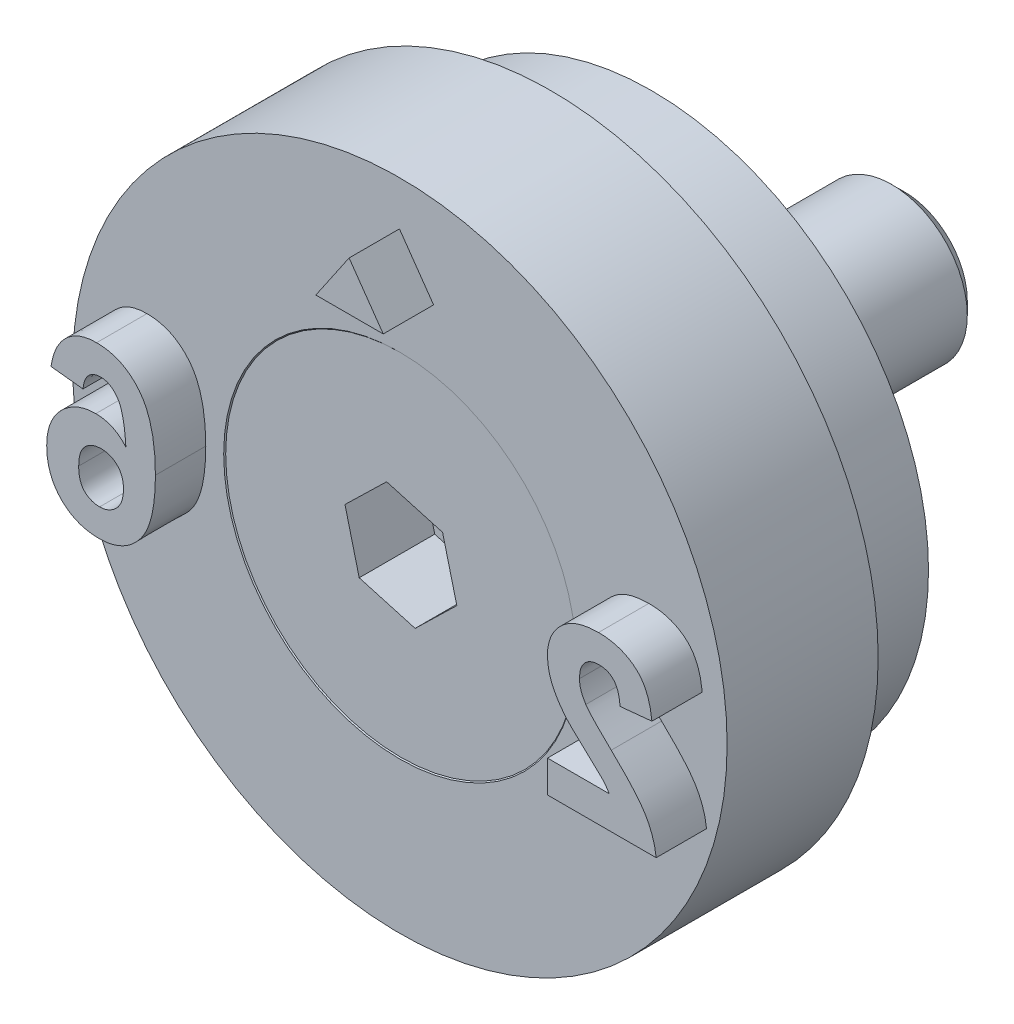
ISO-10303-21;
HEADER;
FILE_DESCRIPTION(('STEP AP214'),'2;1');
FILE_NAME('part.step','',(''),(''),'','','');
FILE_SCHEMA(('AUTOMOTIVE_DESIGN { 1 0 10303 214 1 1 1 1 }'));
ENDSEC;
DATA;
#1=APPLICATION_CONTEXT('core data for automotive mechanical design processes');
#2=APPLICATION_PROTOCOL_DEFINITION('international standard','automotive_design',2000,#1);
#3=PRODUCT_CONTEXT('',#1,'mechanical');
#4=PRODUCT('Part','Part','',(#3));
#5=PRODUCT_RELATED_PRODUCT_CATEGORY('part','',(#4));
#6=PRODUCT_DEFINITION_FORMATION('','',#4);
#7=PRODUCT_DEFINITION_CONTEXT('part definition',#1,'design');
#8=PRODUCT_DEFINITION('design','',#6,#7);
#9=PRODUCT_DEFINITION_SHAPE('','',#8);
#10=(LENGTH_UNIT() NAMED_UNIT(*) SI_UNIT(.MILLI.,.METRE.));
#11=(NAMED_UNIT(*) PLANE_ANGLE_UNIT() SI_UNIT($,.RADIAN.));
#12=(NAMED_UNIT(*) SI_UNIT($,.STERADIAN.) SOLID_ANGLE_UNIT());
#13=UNCERTAINTY_MEASURE_WITH_UNIT(LENGTH_MEASURE(1.E-05),#10,'distance_accuracy_value','');
#14=(GEOMETRIC_REPRESENTATION_CONTEXT(3) GLOBAL_UNCERTAINTY_ASSIGNED_CONTEXT((#13)) GLOBAL_UNIT_ASSIGNED_CONTEXT((#10,
#11,#12)) REPRESENTATION_CONTEXT('',''));
#15=CARTESIAN_POINT('',(0.,0.,0.));
#16=DIRECTION('',(0.,0.,1.));
#17=DIRECTION('',(1.,0.,0.));
#18=AXIS2_PLACEMENT_3D('',#15,#16,#17);
#19=CARTESIAN_POINT('',(0.,0.,-0.0200000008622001));
#20=DIRECTION('',(0.,0.,1.));
#21=DIRECTION('',(1.,0.,0.));
#22=AXIS2_PLACEMENT_3D('',#19,#20,#21);
#23=CYLINDRICAL_SURFACE('',#22,1.5);
#24=CARTESIAN_POINT('',(0.,0.,-2.0000000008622));
#25=DIRECTION('',(0.,0.,1.));
#26=DIRECTION('',(1.,0.,0.));
#27=AXIS2_PLACEMENT_3D('',#24,#25,#26);
#28=CIRCLE('',#27,1.5);
#29=CARTESIAN_POINT('',(1.5,0.,-2.0000000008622));
#30=VERTEX_POINT('',#29);
#31=EDGE_CURVE('E12',#30,#30,#28,.T.);
#32=ORIENTED_EDGE('',*,*,#31,.F.);
#33=EDGE_LOOP('',(#32));
#34=FACE_BOUND('',#33,.T.);
#35=CARTESIAN_POINT('',(0.,0.,-9.7700000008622));
#36=DIRECTION('',(0.,0.,1.));
#37=DIRECTION('',(1.,0.,0.));
#38=AXIS2_PLACEMENT_3D('',#35,#36,#37);
#39=CIRCLE('',#38,1.5);
#40=CARTESIAN_POINT('',(1.5,0.,-9.7700000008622));
#41=VERTEX_POINT('',#40);
#42=EDGE_CURVE('E150',#41,#41,#39,.T.);
#43=ORIENTED_EDGE('',*,*,#42,.T.);
#44=EDGE_LOOP('',(#43));
#45=FACE_BOUND('',#44,.T.);
#46=ADVANCED_FACE('F49',(#34,#45),#23,.T.);
#47=CARTESIAN_POINT('',(0.,0.,-2.0000000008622));
#48=DIRECTION('',(0.,0.,1.));
#49=DIRECTION('',(1.,0.,0.));
#50=AXIS2_PLACEMENT_3D('',#47,#48,#49);
#51=CONICAL_SURFACE('',#50,1.5,0.785398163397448);
#52=CARTESIAN_POINT('',(0.,0.,-0.0200000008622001));
#53=DIRECTION('',(0.,0.,1.));
#54=DIRECTION('',(1.,0.,0.));
#55=AXIS2_PLACEMENT_3D('',#52,#53,#54);
#56=CIRCLE('',#55,3.48);
#57=CARTESIAN_POINT('',(3.48,0.,-0.0200000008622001));
#58=VERTEX_POINT('',#57);
#59=EDGE_CURVE('E56',#58,#58,#56,.T.);
#60=ORIENTED_EDGE('',*,*,#59,.F.);
#61=EDGE_LOOP('',(#60));
#62=FACE_BOUND('',#61,.T.);
#63=ORIENTED_EDGE('',*,*,#31,.T.);
#64=EDGE_LOOP('',(#63));
#65=FACE_BOUND('',#64,.T.);
#66=ADVANCED_FACE('F165',(#62,#65),#51,.T.);
#67=CARTESIAN_POINT('',(0.,3.48,-0.0200000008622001));
#68=DIRECTION('',(0.,0.,-1.));
#69=DIRECTION('',(-1.,0.,0.));
#70=AXIS2_PLACEMENT_3D('',#67,#68,#69);
#71=PLANE('',#70);
#72=DIRECTION('',(0.962144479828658,-0.272539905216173,0.));
#73=VECTOR('',#72,1.);
#74=CARTESIAN_POINT('',(-0.828034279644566,-0.804793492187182,-0.0200000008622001));
#75=LINE('',#74,#73);
#76=CARTESIAN_POINT('',(-0.828034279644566,-0.804793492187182,-0.0200000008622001));
#77=VERTEX_POINT('',#76);
#78=CARTESIAN_POINT('',(0.282954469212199,-1.11949546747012,-0.0200000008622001));
#79=VERTEX_POINT('',#78);
#80=EDGE_CURVE('E137',#77,#79,#75,.T.);
#81=ORIENTED_EDGE('',*,*,#80,.F.);
#82=DIRECTION('',(0.245045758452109,-0.969511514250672,0.));
#83=VECTOR('',#82,1.);
#84=CARTESIAN_POINT('',(-1.11098874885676,0.314701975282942,-0.0200000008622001));
#85=LINE('',#84,#83);
#86=CARTESIAN_POINT('',(-1.11098874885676,0.314701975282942,-0.0200000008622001));
#87=VERTEX_POINT('',#86);
#88=EDGE_CURVE('E63',#87,#77,#85,.T.);
#89=ORIENTED_EDGE('',*,*,#88,.F.);
#90=DIRECTION('',(-0.717098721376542,-0.696971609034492,0.));
#91=VECTOR('',#90,1.);
#92=CARTESIAN_POINT('',(-0.282954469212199,1.11949546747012,-0.0200000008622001));
#93=LINE('',#92,#91);
#94=CARTESIAN_POINT('',(-0.282954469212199,1.11949546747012,-0.0200000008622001));
#95=VERTEX_POINT('',#94);
#96=EDGE_CURVE('E146',#95,#87,#93,.T.);
#97=ORIENTED_EDGE('',*,*,#96,.F.);
#98=DIRECTION('',(-0.962144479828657,0.272539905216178,0.));
#99=VECTOR('',#98,1.);
#100=CARTESIAN_POINT('',(0.828034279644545,0.804793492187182,-0.0200000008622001));
#101=LINE('',#100,#99);
#102=CARTESIAN_POINT('',(0.828034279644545,0.804793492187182,-0.0200000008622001));
#103=VERTEX_POINT('',#102);
#104=EDGE_CURVE('E144',#103,#95,#101,.T.);
#105=ORIENTED_EDGE('',*,*,#104,.F.);
#106=DIRECTION('',(-0.245045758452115,0.96951151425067,0.));
#107=VECTOR('',#106,1.);
#108=CARTESIAN_POINT('',(1.11098874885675,-0.314701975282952,-0.0200000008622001));
#109=LINE('',#108,#107);
#110=CARTESIAN_POINT('',(1.11098874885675,-0.314701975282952,-0.0200000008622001));
#111=VERTEX_POINT('',#110);
#112=EDGE_CURVE('E111',#111,#103,#109,.T.);
#113=ORIENTED_EDGE('',*,*,#112,.F.);
#114=DIRECTION('',(0.717098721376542,0.696971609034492,0.));
#115=VECTOR('',#114,1.);
#116=CARTESIAN_POINT('',(0.282954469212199,-1.11949546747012,-0.0200000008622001));
#117=LINE('',#116,#115);
#118=EDGE_CURVE('E140',#79,#111,#117,.T.);
#119=ORIENTED_EDGE('',*,*,#118,.F.);
#120=EDGE_LOOP('',(#81,#89,#97,#105,#113,#119));
#121=FACE_BOUND('',#120,.T.);
#122=ORIENTED_EDGE('',*,*,#59,.T.);
#123=EDGE_LOOP('',(#122));
#124=FACE_BOUND('',#123,.T.);
#125=ADVANCED_FACE('F163',(#121,#124),#71,.F.);
#126=CARTESIAN_POINT('',(0.,0.,-10.0200000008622));
#127=DIRECTION('',(0.,0.,1.));
#128=DIRECTION('',(1.,0.,0.));
#129=AXIS2_PLACEMENT_3D('',#126,#127,#128);
#130=PLANE('',#129);
#131=CARTESIAN_POINT('',(0.,0.,-10.0200000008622));
#132=DIRECTION('',(0.,0.,1.));
#133=DIRECTION('',(1.,0.,0.));
#134=AXIS2_PLACEMENT_3D('',#131,#132,#133);
#135=CIRCLE('',#134,1.25);
#136=CARTESIAN_POINT('',(1.25,0.,-10.0200000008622));
#137=VERTEX_POINT('',#136);
#138=EDGE_CURVE('E158',#137,#137,#135,.T.);
#139=ORIENTED_EDGE('',*,*,#138,.F.);
#140=EDGE_LOOP('',(#139));
#141=FACE_BOUND('',#140,.T.);
#142=ADVANCED_FACE('F178',(#141),#130,.F.);
#143=CARTESIAN_POINT('',(0.,0.,-10.0200000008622));
#144=DIRECTION('',(0.,0.,1.));
#145=DIRECTION('',(1.,0.,0.));
#146=AXIS2_PLACEMENT_3D('',#143,#144,#145);
#147=CONICAL_SURFACE('',#146,1.25,0.78539816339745);
#148=ORIENTED_EDGE('',*,*,#42,.F.);
#149=EDGE_LOOP('',(#148));
#150=FACE_BOUND('',#149,.T.);
#151=ORIENTED_EDGE('',*,*,#138,.T.);
#152=EDGE_LOOP('',(#151));
#153=FACE_BOUND('',#152,.T.);
#154=ADVANCED_FACE('F174',(#150,#153),#147,.T.);
#155=CARTESIAN_POINT('',(-1.11098874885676,0.314701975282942,-1.5200000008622));
#156=DIRECTION('',(-0.969511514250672,-0.245045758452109,0.));
#157=DIRECTION('',(0.245045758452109,-0.969511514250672,0.));
#158=AXIS2_PLACEMENT_3D('',#155,#156,#157);
#159=PLANE('',#158);
#160=ORIENTED_EDGE('',*,*,#88,.T.);
#161=DIRECTION('',(0.,0.,1.));
#162=VECTOR('',#161,1.);
#163=CARTESIAN_POINT('',(-0.828034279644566,-0.804793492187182,-1.5200000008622));
#164=LINE('',#163,#162);
#165=CARTESIAN_POINT('',(-0.828034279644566,-0.804793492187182,-1.5200000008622));
#166=VERTEX_POINT('',#165);
#167=EDGE_CURVE('E93',#166,#77,#164,.T.);
#168=ORIENTED_EDGE('',*,*,#167,.F.);
#169=DIRECTION('',(0.245045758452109,-0.969511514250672,0.));
#170=VECTOR('',#169,1.);
#171=CARTESIAN_POINT('',(-1.11098874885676,0.314701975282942,-1.5200000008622));
#172=LINE('',#171,#170);
#173=CARTESIAN_POINT('',(-1.11098874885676,0.314701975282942,-1.5200000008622));
#174=VERTEX_POINT('',#173);
#175=EDGE_CURVE('E148',#174,#166,#172,.T.);
#176=ORIENTED_EDGE('',*,*,#175,.F.);
#177=DIRECTION('',(0.,0.,1.));
#178=VECTOR('',#177,1.);
#179=CARTESIAN_POINT('',(-1.11098874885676,0.314701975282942,-1.5200000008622));
#180=LINE('',#179,#178);
#181=EDGE_CURVE('E71',#174,#87,#180,.T.);
#182=ORIENTED_EDGE('',*,*,#181,.T.);
#183=EDGE_LOOP('',(#160,#168,#176,#182));
#184=FACE_BOUND('',#183,.T.);
#185=ADVANCED_FACE('F177',(#184),#159,.F.);
#186=CARTESIAN_POINT('',(-0.282954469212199,1.11949546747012,-1.5200000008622));
#187=DIRECTION('',(-0.696971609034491,0.717098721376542,0.));
#188=DIRECTION('',(-0.717098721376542,-0.696971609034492,0.));
#189=AXIS2_PLACEMENT_3D('',#186,#187,#188);
#190=PLANE('',#189);
#191=ORIENTED_EDGE('',*,*,#96,.T.);
#192=ORIENTED_EDGE('',*,*,#181,.F.);
#193=DIRECTION('',(-0.717098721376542,-0.696971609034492,0.));
#194=VECTOR('',#193,1.);
#195=CARTESIAN_POINT('',(-0.282954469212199,1.11949546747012,-1.5200000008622));
#196=LINE('',#195,#194);
#197=CARTESIAN_POINT('',(-0.282954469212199,1.11949546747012,-1.5200000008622));
#198=VERTEX_POINT('',#197);
#199=EDGE_CURVE('E123',#198,#174,#196,.T.);
#200=ORIENTED_EDGE('',*,*,#199,.F.);
#201=DIRECTION('',(0.,0.,1.));
#202=VECTOR('',#201,1.);
#203=CARTESIAN_POINT('',(-0.282954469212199,1.11949546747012,-1.5200000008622));
#204=LINE('',#203,#202);
#205=EDGE_CURVE('E115',#198,#95,#204,.T.);
#206=ORIENTED_EDGE('',*,*,#205,.T.);
#207=EDGE_LOOP('',(#191,#192,#200,#206));
#208=FACE_BOUND('',#207,.T.);
#209=ADVANCED_FACE('F192',(#208),#190,.F.);
#210=CARTESIAN_POINT('',(0.828034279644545,0.804793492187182,-1.5200000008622));
#211=DIRECTION('',(0.272539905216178,0.962144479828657,0.));
#212=DIRECTION('',(-0.962144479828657,0.272539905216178,0.));
#213=AXIS2_PLACEMENT_3D('',#210,#211,#212);
#214=PLANE('',#213);
#215=ORIENTED_EDGE('',*,*,#104,.T.);
#216=ORIENTED_EDGE('',*,*,#205,.F.);
#217=DIRECTION('',(-0.962144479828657,0.272539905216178,0.));
#218=VECTOR('',#217,1.);
#219=CARTESIAN_POINT('',(0.828034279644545,0.804793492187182,-1.5200000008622));
#220=LINE('',#219,#218);
#221=CARTESIAN_POINT('',(0.828034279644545,0.804793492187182,-1.5200000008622));
#222=VERTEX_POINT('',#221);
#223=EDGE_CURVE('E119',#222,#198,#220,.T.);
#224=ORIENTED_EDGE('',*,*,#223,.F.);
#225=DIRECTION('',(0.,0.,1.));
#226=VECTOR('',#225,1.);
#227=CARTESIAN_POINT('',(0.828034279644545,0.804793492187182,-1.5200000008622));
#228=LINE('',#227,#226);
#229=EDGE_CURVE('E104',#222,#103,#228,.T.);
#230=ORIENTED_EDGE('',*,*,#229,.T.);
#231=EDGE_LOOP('',(#215,#216,#224,#230));
#232=FACE_BOUND('',#231,.T.);
#233=ADVANCED_FACE('F120',(#232),#214,.F.);
#234=CARTESIAN_POINT('',(1.11098874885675,-0.314701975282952,-1.5200000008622));
#235=DIRECTION('',(0.96951151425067,0.245045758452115,0.));
#236=DIRECTION('',(-0.245045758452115,0.96951151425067,0.));
#237=AXIS2_PLACEMENT_3D('',#234,#235,#236);
#238=PLANE('',#237);
#239=ORIENTED_EDGE('',*,*,#112,.T.);
#240=ORIENTED_EDGE('',*,*,#229,.F.);
#241=DIRECTION('',(-0.245045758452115,0.96951151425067,0.));
#242=VECTOR('',#241,1.);
#243=CARTESIAN_POINT('',(1.11098874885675,-0.314701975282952,-1.5200000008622));
#244=LINE('',#243,#242);
#245=CARTESIAN_POINT('',(1.11098874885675,-0.314701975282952,-1.5200000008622));
#246=VERTEX_POINT('',#245);
#247=EDGE_CURVE('E108',#246,#222,#244,.T.);
#248=ORIENTED_EDGE('',*,*,#247,.F.);
#249=DIRECTION('',(0.,0.,1.));
#250=VECTOR('',#249,1.);
#251=CARTESIAN_POINT('',(1.11098874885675,-0.314701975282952,-1.5200000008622));
#252=LINE('',#251,#250);
#253=EDGE_CURVE('E116',#246,#111,#252,.T.);
#254=ORIENTED_EDGE('',*,*,#253,.T.);
#255=EDGE_LOOP('',(#239,#240,#248,#254));
#256=FACE_BOUND('',#255,.T.);
#257=ADVANCED_FACE('F106',(#256),#238,.F.);
#258=CARTESIAN_POINT('',(0.282954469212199,-1.11949546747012,-1.5200000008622));
#259=DIRECTION('',(0.696971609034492,-0.717098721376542,0.));
#260=DIRECTION('',(0.717098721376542,0.696971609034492,0.));
#261=AXIS2_PLACEMENT_3D('',#258,#259,#260);
#262=PLANE('',#261);
#263=ORIENTED_EDGE('',*,*,#118,.T.);
#264=ORIENTED_EDGE('',*,*,#253,.F.);
#265=DIRECTION('',(0.717098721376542,0.696971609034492,0.));
#266=VECTOR('',#265,1.);
#267=CARTESIAN_POINT('',(0.282954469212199,-1.11949546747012,-1.5200000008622));
#268=LINE('',#267,#266);
#269=CARTESIAN_POINT('',(0.282954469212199,-1.11949546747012,-1.5200000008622));
#270=VERTEX_POINT('',#269);
#271=EDGE_CURVE('E129',#270,#246,#268,.T.);
#272=ORIENTED_EDGE('',*,*,#271,.F.);
#273=DIRECTION('',(0.,0.,1.));
#274=VECTOR('',#273,1.);
#275=CARTESIAN_POINT('',(0.282954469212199,-1.11949546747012,-1.5200000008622));
#276=LINE('',#275,#274);
#277=EDGE_CURVE('E153',#270,#79,#276,.T.);
#278=ORIENTED_EDGE('',*,*,#277,.T.);
#279=EDGE_LOOP('',(#263,#264,#272,#278));
#280=FACE_BOUND('',#279,.T.);
#281=ADVANCED_FACE('F196',(#280),#262,.F.);
#282=CARTESIAN_POINT('',(-0.828034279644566,-0.804793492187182,-1.5200000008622));
#283=DIRECTION('',(-0.272539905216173,-0.962144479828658,0.));
#284=DIRECTION('',(0.962144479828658,-0.272539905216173,0.));
#285=AXIS2_PLACEMENT_3D('',#282,#283,#284);
#286=PLANE('',#285);
#287=ORIENTED_EDGE('',*,*,#80,.T.);
#288=ORIENTED_EDGE('',*,*,#277,.F.);
#289=DIRECTION('',(0.962144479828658,-0.272539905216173,0.));
#290=VECTOR('',#289,1.);
#291=CARTESIAN_POINT('',(-0.828034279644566,-0.804793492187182,-1.5200000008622));
#292=LINE('',#291,#290);
#293=EDGE_CURVE('E131',#166,#270,#292,.T.);
#294=ORIENTED_EDGE('',*,*,#293,.F.);
#295=ORIENTED_EDGE('',*,*,#167,.T.);
#296=EDGE_LOOP('',(#287,#288,#294,#295));
#297=FACE_BOUND('',#296,.T.);
#298=ADVANCED_FACE('F193',(#297),#286,.F.);
#299=CARTESIAN_POINT('',(0.,0.,-1.5200000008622));
#300=DIRECTION('',(0.,0.,1.));
#301=DIRECTION('',(1.,0.,0.));
#302=AXIS2_PLACEMENT_3D('',#299,#300,#301);
#303=PLANE('',#302);
#304=ORIENTED_EDGE('',*,*,#175,.T.);
#305=ORIENTED_EDGE('',*,*,#293,.T.);
#306=ORIENTED_EDGE('',*,*,#271,.T.);
#307=ORIENTED_EDGE('',*,*,#247,.T.);
#308=ORIENTED_EDGE('',*,*,#223,.T.);
#309=ORIENTED_EDGE('',*,*,#199,.T.);
#310=EDGE_LOOP('',(#304,#305,#306,#307,#308,#309));
#311=FACE_BOUND('',#310,.T.);
#312=ADVANCED_FACE('F126',(#311),#303,.T.);
#313=CLOSED_SHELL('',(#46,#66,#125,#142,#154,#185,#209,#233,#257,#281,#298,#312));
#314=MANIFOLD_SOLID_BREP('B2',#313);
#315=CARTESIAN_POINT('',(0.,6.5,0.));
#316=DIRECTION('',(0.,0.,-1.));
#317=DIRECTION('',(-1.,0.,0.));
#318=AXIS2_PLACEMENT_3D('',#315,#316,#317);
#319=PLANE('',#318);
#320=CARTESIAN_POINT('',(-5.02410875,1.651,0.));
#321=CARTESIAN_POINT('',(-5.05391018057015,1.65046385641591,0.));
#322=CARTESIAN_POINT('',(-5.11216816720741,1.64941576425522,0.));
#323=CARTESIAN_POINT('',(-5.19755363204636,1.63828589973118,0.));
#324=CARTESIAN_POINT('',(-5.27901057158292,1.62126653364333,0.));
#325=CARTESIAN_POINT('',(-5.35675247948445,1.59770778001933,0.));
#326=CARTESIAN_POINT('',(-5.43023199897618,1.56615805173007,0.));
#327=CARTESIAN_POINT('',(-5.49974091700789,1.52772317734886,0.));
#328=CARTESIAN_POINT('',(-5.56551290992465,1.48250725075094,0.));
#329=CARTESIAN_POINT('',(-5.62720576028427,1.43080138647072,0.));
#330=CARTESIAN_POINT('',(-5.68432294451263,1.37244909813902,0.));
#331=CARTESIAN_POINT('',(-5.73589843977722,1.30731836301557,0.));
#332=CARTESIAN_POINT('',(-5.78227380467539,1.23619522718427,0.));
#333=CARTESIAN_POINT('',(-5.82365200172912,1.15913871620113,0.));
#334=CARTESIAN_POINT('',(-5.85835935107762,1.07541082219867,0.));
#335=CARTESIAN_POINT('',(-5.88819604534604,0.985669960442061,0.));
#336=CARTESIAN_POINT('',(-5.91273465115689,0.88972333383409,0.));
#337=CARTESIAN_POINT('',(-5.9243600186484,0.823165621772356,0.));
#338=CARTESIAN_POINT('',(-5.93030666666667,0.789119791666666,0.));
#339=B_SPLINE_CURVE_WITH_KNOTS('',3,(#320,#321,#322,#323,#324,#325,#326,#327,#328,#329,#330,
#331,#332,#333,#334,#335,#336,#337,#338),.UNSPECIFIED.,.F.,.F.,(4,1,1,1,1,1,1,1,1,1,1,1,1,1,1,1,
4),(0.,0.0647517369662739,0.126581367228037,0.186839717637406,0.245514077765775,
0.302849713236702,0.360345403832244,0.417912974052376,0.476091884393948,0.535068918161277,
0.595103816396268,0.656390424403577,0.719434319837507,0.784953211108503,0.853160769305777,
0.924888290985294,1.),.UNSPECIFIED.);
#340=CARTESIAN_POINT('',(-5.02410875,1.651,0.));
#341=VERTEX_POINT('',#340);
#342=CARTESIAN_POINT('',(-5.93030666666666,0.789119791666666,0.));
#343=VERTEX_POINT('',#342);
#344=EDGE_CURVE('E574',#341,#343,#339,.T.);
#345=ORIENTED_EDGE('',*,*,#344,.F.);
#346=CARTESIAN_POINT('',(-3.85597333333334,-0.0443177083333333,0.));
#347=CARTESIAN_POINT('',(-3.85696059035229,0.0280311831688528,0.));
#348=CARTESIAN_POINT('',(-3.85886820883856,0.167826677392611,0.));
#349=CARTESIAN_POINT('',(-3.87421863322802,0.36967222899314,0.));
#350=CARTESIAN_POINT('',(-3.89860142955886,0.556068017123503,0.));
#351=CARTESIAN_POINT('',(-3.93412108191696,0.726593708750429,0.));
#352=CARTESIAN_POINT('',(-3.97955346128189,0.881603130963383,0.));
#353=CARTESIAN_POINT('',(-4.03463288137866,1.02140779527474,0.));
#354=CARTESIAN_POINT('',(-4.10074311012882,1.145501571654,0.));
#355=CARTESIAN_POINT('',(-4.17760659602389,1.25348089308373,0.));
#356=CARTESIAN_POINT('',(-4.26217858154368,1.3473433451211,0.));
#357=CARTESIAN_POINT('',(-4.35305155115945,1.42836257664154,0.));
#358=CARTESIAN_POINT('',(-4.4498785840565,1.49732201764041,0.));
#359=CARTESIAN_POINT('',(-4.5526573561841,1.55404753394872,0.));
#360=CARTESIAN_POINT('',(-4.6622315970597,1.59705082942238,0.));
#361=CARTESIAN_POINT('',(-4.77756196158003,1.62810458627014,0.));
#362=CARTESIAN_POINT('',(-4.89884216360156,1.64806234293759,0.));
#363=CARTESIAN_POINT('',(-4.9819171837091,1.65001055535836,0.));
#364=CARTESIAN_POINT('',(-5.02410875,1.651,0.));
#365=B_SPLINE_CURVE_WITH_KNOTS('',3,(#346,#347,#348,#349,#350,#351,#352,#353,#354,#355,#356,
#357,#358,#359,#360,#361,#362,#363,#364),.UNSPECIFIED.,.F.,.F.,(4,1,1,1,1,1,1,1,1,1,1,1,1,1,1,1,
4),(0.,0.0932311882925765,0.180145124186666,0.260720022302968,0.335343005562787,
0.404393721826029,0.468663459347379,0.528671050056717,0.585123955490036,0.639046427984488,
0.691174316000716,0.74171432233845,0.791946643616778,0.842075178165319,0.893016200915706,
0.945665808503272,1.),.UNSPECIFIED.);
#366=CARTESIAN_POINT('',(-3.85597333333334,-0.0443177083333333,0.));
#367=VERTEX_POINT('',#366);
#368=EDGE_CURVE('E634',#367,#341,#365,.T.);
#369=ORIENTED_EDGE('',*,*,#368,.F.);
#370=CARTESIAN_POINT('',(-4.97648375,-1.69333333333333,0.));
#371=CARTESIAN_POINT('',(-4.93651094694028,-1.69221500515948,0.));
#372=CARTESIAN_POINT('',(-4.85791730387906,-1.69001617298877,0.));
#373=CARTESIAN_POINT('',(-4.7428649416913,-1.67192089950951,0.));
#374=CARTESIAN_POINT('',(-4.63348295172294,-1.6413065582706,0.));
#375=CARTESIAN_POINT('',(-4.52978492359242,-1.59855232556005,0.));
#376=CARTESIAN_POINT('',(-4.43090895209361,-1.54477412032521,0.));
#377=CARTESIAN_POINT('',(-4.33777317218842,-1.47797178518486,0.));
#378=CARTESIAN_POINT('',(-4.25062439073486,-1.3987823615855,0.));
#379=CARTESIAN_POINT('',(-4.16830992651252,-1.30827825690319,0.));
#380=CARTESIAN_POINT('',(-4.09340596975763,-1.20373886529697,0.));
#381=CARTESIAN_POINT('',(-4.02961712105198,-1.08291331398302,0.));
#382=CARTESIAN_POINT('',(-3.97551778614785,-0.947124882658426,0.));
#383=CARTESIAN_POINT('',(-3.93147300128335,-0.796025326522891,0.));
#384=CARTESIAN_POINT('',(-3.89747360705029,-0.629626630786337,0.));
#385=CARTESIAN_POINT('',(-3.87374960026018,-0.447914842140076,0.));
#386=CARTESIAN_POINT('',(-3.85799190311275,-0.251190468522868,0.));
#387=CARTESIAN_POINT('',(-3.85666210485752,-0.114906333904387,0.));
#388=CARTESIAN_POINT('',(-3.85597333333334,-0.0443177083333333,0.));
#389=B_SPLINE_CURVE_WITH_KNOTS('',3,(#370,#371,#372,#373,#374,#375,#376,#377,#378,#379,#380,
#381,#382,#383,#384,#385,#386,#387,#388),.UNSPECIFIED.,.F.,.F.,(4,1,1,1,1,1,1,1,1,1,1,1,1,1,1,1,
4),(0.,0.0532594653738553,0.104717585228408,0.154775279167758,0.204330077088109,
0.253913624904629,0.30447604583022,0.356706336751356,0.410596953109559,0.467274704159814,
0.527625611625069,0.59224090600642,0.661798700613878,0.737130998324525,0.818387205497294,
0.905933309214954,1.),.UNSPECIFIED.);
#390=CARTESIAN_POINT('',(-4.97648375,-1.69333333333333,0.));
#391=VERTEX_POINT('',#390);
#392=EDGE_CURVE('E626',#391,#367,#389,.T.);
#393=ORIENTED_EDGE('',*,*,#392,.F.);
#394=CARTESIAN_POINT('',(-6.01497333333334,-0.616479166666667,0.));
#395=CARTESIAN_POINT('',(-6.01405676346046,-0.656200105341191,0.));
#396=CARTESIAN_POINT('',(-6.01226923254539,-0.73366545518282,0.));
#397=CARTESIAN_POINT('',(-5.99911175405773,-0.847115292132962,0.));
#398=CARTESIAN_POINT('',(-5.97587005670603,-0.95419916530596,0.));
#399=CARTESIAN_POINT('',(-5.94411688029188,-1.05577621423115,0.));
#400=CARTESIAN_POINT('',(-5.90304507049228,-1.15104154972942,0.));
#401=CARTESIAN_POINT('',(-5.85328990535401,-1.24078025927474,0.));
#402=CARTESIAN_POINT('',(-5.79316763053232,-1.32345878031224,0.));
#403=CARTESIAN_POINT('',(-5.7254067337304,-1.40018925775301,0.));
#404=CARTESIAN_POINT('',(-5.64986674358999,-1.4686612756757,0.));
#405=CARTESIAN_POINT('',(-5.56936256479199,-1.52929405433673,0.));
#406=CARTESIAN_POINT('',(-5.48300129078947,-1.5796963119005,0.));
#407=CARTESIAN_POINT('',(-5.39205944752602,-1.62211844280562,0.));
#408=CARTESIAN_POINT('',(-5.29497504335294,-1.65325071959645,0.));
#409=CARTESIAN_POINT('',(-5.19345965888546,-1.67659836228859,0.));
#410=CARTESIAN_POINT('',(-5.08668784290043,-1.69083833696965,0.));
#411=CARTESIAN_POINT('',(-5.01378988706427,-1.69248873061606,0.));
#412=CARTESIAN_POINT('',(-4.97648375,-1.69333333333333,0.));
#413=B_SPLINE_CURVE_WITH_KNOTS('',3,(#394,#395,#396,#397,#398,#399,#400,#401,#402,#403,#404,
#405,#406,#407,#408,#409,#410,#411,#412),.UNSPECIFIED.,.F.,.F.,(4,1,1,1,1,1,1,1,1,1,1,1,1,1,1,1,
4),(0.,0.0708046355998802,0.13808600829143,0.203231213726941,0.265884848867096,
0.327509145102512,0.387868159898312,0.448411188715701,0.509386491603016,0.570040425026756,
0.629864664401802,0.68871511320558,0.747985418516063,0.808394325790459,0.870086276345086,
0.933515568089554,1.),.UNSPECIFIED.);
#414=CARTESIAN_POINT('',(-6.01497333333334,-0.616479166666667,0.));
#415=VERTEX_POINT('',#414);
#416=EDGE_CURVE('E618',#415,#391,#413,.T.);
#417=ORIENTED_EDGE('',*,*,#416,.F.);
#418=CARTESIAN_POINT('',(-5.03932229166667,0.423333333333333,0.));
#419=CARTESIAN_POINT('',(-5.07221259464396,0.422386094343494,0.));
#420=CARTESIAN_POINT('',(-5.13715926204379,0.42051563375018,0.));
#421=CARTESIAN_POINT('',(-5.2328407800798,0.407396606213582,0.));
#422=CARTESIAN_POINT('',(-5.32465348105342,0.383806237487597,0.));
#423=CARTESIAN_POINT('',(-5.41301270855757,0.351894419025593,0.));
#424=CARTESIAN_POINT('',(-5.49835517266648,0.311709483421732,0.));
#425=CARTESIAN_POINT('',(-5.579048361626,0.26084135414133,0.));
#426=CARTESIAN_POINT('',(-5.65635894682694,0.201531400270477,0.));
#427=CARTESIAN_POINT('',(-5.72922367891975,0.133770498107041,0.));
#428=CARTESIAN_POINT('',(-5.79616884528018,0.0591714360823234,0.));
#429=CARTESIAN_POINT('',(-5.85527480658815,-0.0214014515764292,0.));
#430=CARTESIAN_POINT('',(-5.90391707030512,-0.108194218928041,0.));
#431=CARTESIAN_POINT('',(-5.94550037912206,-0.199263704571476,0.));
#432=CARTESIAN_POINT('',(-5.97643994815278,-0.296407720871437,0.));
#433=CARTESIAN_POINT('',(-5.99889880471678,-0.398228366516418,0.));
#434=CARTESIAN_POINT('',(-6.01230516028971,-0.505660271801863,0.));
#435=CARTESIAN_POINT('',(-6.01406994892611,-0.578958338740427,0.));
#436=CARTESIAN_POINT('',(-6.01497333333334,-0.616479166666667,0.));
#437=B_SPLINE_CURVE_WITH_KNOTS('',3,(#418,#419,#420,#421,#422,#423,#424,#425,#426,#427,#428,
#429,#430,#431,#432,#433,#434,#435,#436),.UNSPECIFIED.,.F.,.F.,(4,1,1,1,1,1,1,1,1,1,1,1,1,1,1,1,
4),(0.,0.0619593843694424,0.122347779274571,0.181484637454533,0.240217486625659,
0.299114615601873,0.358819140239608,0.419550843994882,0.482449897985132,0.545990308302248,
0.608137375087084,0.670271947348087,0.73311337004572,0.796428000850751,0.861936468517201,
0.9293261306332,1.),.UNSPECIFIED.);
#438=CARTESIAN_POINT('',(-5.03932229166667,0.423333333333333,0.));
#439=VERTEX_POINT('',#438);
#440=EDGE_CURVE('E610',#439,#415,#437,.T.);
#441=ORIENTED_EDGE('',*,*,#440,.F.);
#442=CARTESIAN_POINT('',(-4.442686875,0.14684375,0.));
#443=CARTESIAN_POINT('',(-4.46298156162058,0.168886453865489,0.));
#444=CARTESIAN_POINT('',(-4.50277730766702,0.212109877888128,0.));
#445=CARTESIAN_POINT('',(-4.56881100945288,0.268463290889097,0.));
#446=CARTESIAN_POINT('',(-4.63799113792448,0.316641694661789,0.));
#447=CARTESIAN_POINT('',(-4.71107047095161,0.356167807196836,0.));
#448=CARTESIAN_POINT('',(-4.78844790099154,0.385581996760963,0.));
#449=CARTESIAN_POINT('',(-4.86872179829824,0.407915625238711,0.));
#450=CARTESIAN_POINT('',(-4.95294295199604,0.420425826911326,0.));
#451=CARTESIAN_POINT('',(-5.01017929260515,0.422352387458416,0.));
#452=CARTESIAN_POINT('',(-5.03932229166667,0.423333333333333,0.));
#453=B_SPLINE_CURVE_WITH_KNOTS('',3,(#442,#443,#444,#445,#446,#447,#448,#449,#450,#451,#452),
.UNSPECIFIED.,.F.,.F.,(4,1,1,1,1,1,1,1,4),(0.,0.132218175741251,0.259265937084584,
0.382426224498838,0.503963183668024,0.625109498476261,0.74722619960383,0.87129528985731,1.),.UNSPECIFIED.);
#454=CARTESIAN_POINT('',(-4.442686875,0.14684375,0.));
#455=VERTEX_POINT('',#454);
#456=EDGE_CURVE('E602',#455,#439,#453,.T.);
#457=ORIENTED_EDGE('',*,*,#456,.F.);
#458=CARTESIAN_POINT('',(-4.942749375,1.10066666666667,0.));
#459=CARTESIAN_POINT('',(-4.92682371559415,1.10027724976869,0.));
#460=CARTESIAN_POINT('',(-4.89513245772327,1.09950232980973,0.));
#461=CARTESIAN_POINT('',(-4.84897029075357,1.08966392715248,0.));
#462=CARTESIAN_POINT('',(-4.8044644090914,1.07506367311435,0.));
#463=CARTESIAN_POINT('',(-4.76197804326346,1.0543854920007,0.));
#464=CARTESIAN_POINT('',(-4.72129920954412,1.0277041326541,0.));
#465=CARTESIAN_POINT('',(-4.68304632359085,0.994700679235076,0.));
#466=CARTESIAN_POINT('',(-4.64546074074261,0.957114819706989,0.));
#467=CARTESIAN_POINT('',(-4.61075471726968,0.911728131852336,0.));
#468=CARTESIAN_POINT('',(-4.57745832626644,0.857987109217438,0.));
#469=CARTESIAN_POINT('',(-4.54878878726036,0.792197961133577,0.));
#470=CARTESIAN_POINT('',(-4.52323560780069,0.714421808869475,0.));
#471=CARTESIAN_POINT('',(-4.50135661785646,0.624277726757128,0.));
#472=CARTESIAN_POINT('',(-4.48150165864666,0.522337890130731,0.));
#473=CARTESIAN_POINT('',(-4.46522622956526,0.408189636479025,0.));
#474=CARTESIAN_POINT('',(-4.45220272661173,0.281730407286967,0.));
#475=CARTESIAN_POINT('',(-4.44595484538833,0.193167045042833,0.));
#476=CARTESIAN_POINT('',(-4.442686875,0.14684375,0.));
#477=B_SPLINE_CURVE_WITH_KNOTS('',3,(#458,#459,#460,#461,#462,#463,#464,#465,#466,#467,#468,
#469,#470,#471,#472,#473,#474,#475,#476),.UNSPECIFIED.,.F.,.F.,(4,1,1,1,1,1,1,1,1,1,1,1,1,1,1,1,
4),(0.,0.0401536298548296,0.0799036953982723,0.118642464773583,0.158240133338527,
0.198858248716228,0.241137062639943,0.285631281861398,0.332856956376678,0.385095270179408,
0.444912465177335,0.513585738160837,0.591645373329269,0.679009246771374,0.775790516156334,
0.882726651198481,1.),.UNSPECIFIED.);
#478=CARTESIAN_POINT('',(-4.942749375,1.10066666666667,0.));
#479=VERTEX_POINT('',#478);
#480=EDGE_CURVE('E594',#479,#455,#477,.T.);
#481=ORIENTED_EDGE('',*,*,#480,.F.);
#482=CARTESIAN_POINT('',(-5.29530666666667,0.719666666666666,0.));
#483=CARTESIAN_POINT('',(-5.29105237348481,0.750251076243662,0.));
#484=CARTESIAN_POINT('',(-5.28304657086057,0.807805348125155,0.));
#485=CARTESIAN_POINT('',(-5.25933379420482,0.887230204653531,0.));
#486=CARTESIAN_POINT('',(-5.22632292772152,0.954046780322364,0.));
#487=CARTESIAN_POINT('',(-5.18395027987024,1.00834849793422,0.));
#488=CARTESIAN_POINT('',(-5.13347999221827,1.05014135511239,0.));
#489=CARTESIAN_POINT('',(-5.07597182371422,1.07983772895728,0.));
#490=CARTESIAN_POINT('',(-5.01146232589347,1.09746622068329,0.));
#491=CARTESIAN_POINT('',(-4.96623412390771,1.09957281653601,0.));
#492=CARTESIAN_POINT('',(-4.942749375,1.10066666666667,0.));
#493=B_SPLINE_CURVE_WITH_KNOTS('',3,(#482,#483,#484,#485,#486,#487,#488,#489,#490,#491,#492),
.UNSPECIFIED.,.F.,.F.,(4,1,1,1,1,1,1,1,4),(0.,0.160089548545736,0.301259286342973,
0.4281718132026,0.544692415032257,0.656041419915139,0.765564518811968,0.878269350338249,1.),.UNSPECIFIED.);
#494=CARTESIAN_POINT('',(-5.29530666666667,0.719666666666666,0.));
#495=VERTEX_POINT('',#494);
#496=EDGE_CURVE('E589',#495,#479,#493,.T.);
#497=ORIENTED_EDGE('',*,*,#496,.F.);
#498=DIRECTION('',(0.994071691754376,-0.108726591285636,0.));
#499=VECTOR('',#498,1.);
#500=CARTESIAN_POINT('',(-5.93030666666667,0.789119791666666,0.));
#501=LINE('',#500,#499);
#502=EDGE_CURVE('E582',#343,#495,#501,.T.);
#503=ORIENTED_EDGE('',*,*,#502,.F.);
#504=EDGE_LOOP('',(#345,#369,#393,#417,#441,#457,#481,#497,#503));
#505=FACE_BOUND('',#504,.T.);
#506=CARTESIAN_POINT('',(0.,0.,0.));
#507=DIRECTION('',(0.,0.,1.));
#508=DIRECTION('',(1.,0.,0.));
#509=AXIS2_PLACEMENT_3D('',#506,#507,#508);
#510=CIRCLE('',#509,6.5);
#511=CARTESIAN_POINT('',(6.5,0.,0.));
#512=VERTEX_POINT('',#511);
#513=EDGE_CURVE('E47',#512,#512,#510,.T.);
#514=ORIENTED_EDGE('',*,*,#513,.T.);
#515=EDGE_LOOP('',(#514));
#516=FACE_BOUND('',#515,.T.);
#517=CARTESIAN_POINT('',(0.,0.,0.));
#518=DIRECTION('',(0.,0.,1.));
#519=DIRECTION('',(1.,0.,0.));
#520=AXIS2_PLACEMENT_3D('',#517,#518,#519);
#521=CIRCLE('',#520,3.5000000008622);
#522=CARTESIAN_POINT('',(3.5000000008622,0.,0.));
#523=VERTEX_POINT('',#522);
#524=EDGE_CURVE('E317',#523,#523,#521,.T.);
#525=ORIENTED_EDGE('',*,*,#524,.F.);
#526=EDGE_LOOP('',(#525));
#527=FACE_BOUND('',#526,.T.);
#528=DIRECTION('',(-1.,0.,0.));
#529=VECTOR('',#528,1.);
#530=CARTESIAN_POINT('',(5.158671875,-1.016,0.));
#531=LINE('',#530,#529);
#532=CARTESIAN_POINT('',(5.158671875,-1.016,0.));
#533=VERTEX_POINT('',#532);
#534=CARTESIAN_POINT('',(3.93166666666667,-1.016,0.));
#535=VERTEX_POINT('',#534);
#536=EDGE_CURVE('E672',#533,#535,#531,.T.);
#537=ORIENTED_EDGE('',*,*,#536,.F.);
#538=CARTESIAN_POINT('',(4.2518125,-0.07540625,0.));
#539=CARTESIAN_POINT('',(4.26185584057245,-0.0880558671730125,0.));
#540=CARTESIAN_POINT('',(4.28336634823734,-0.115148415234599,0.));
#541=CARTESIAN_POINT('',(4.31996137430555,-0.156690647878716,0.));
#542=CARTESIAN_POINT('',(4.36237186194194,-0.202067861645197,0.));
#543=CARTESIAN_POINT('',(4.40999878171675,-0.252129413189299,0.));
#544=CARTESIAN_POINT('',(4.46441534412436,-0.305102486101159,0.));
#545=CARTESIAN_POINT('',(4.52366363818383,-0.363202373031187,0.));
#546=CARTESIAN_POINT('',(4.59035076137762,-0.423457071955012,0.));
#547=CARTESIAN_POINT('',(4.65942246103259,-0.487369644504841,0.));
#548=CARTESIAN_POINT('',(4.7287943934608,-0.549574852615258,0.));
#549=CARTESIAN_POINT('',(4.79255720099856,-0.608656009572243,0.));
#550=CARTESIAN_POINT('',(4.8504750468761,-0.660930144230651,0.));
#551=CARTESIAN_POINT('',(4.89985058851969,-0.709283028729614,0.));
#552=CARTESIAN_POINT('',(4.94358808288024,-0.750414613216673,0.));
#553=CARTESIAN_POINT('',(4.98011108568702,-0.786434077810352,0.));
#554=CARTESIAN_POINT('',(5.01010302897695,-0.816469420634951,0.));
#555=CARTESIAN_POINT('',(5.0514299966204,-0.863286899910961,0.));
#556=CARTESIAN_POINT('',(5.10401387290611,-0.926607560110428,0.));
#557=CARTESIAN_POINT('',(5.14100877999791,-0.987112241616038,0.));
#558=CARTESIAN_POINT('',(5.158671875,-1.016,0.));
#559=B_SPLINE_CURVE_WITH_KNOTS('',3,(#538,#539,#540,#541,#542,#543,#544,#545,#546,#547,#548,
#549,#550,#551,#552,#553,#554,#555,#556,#557,#558),.UNSPECIFIED.,.F.,.F.,(4,1,1,1,1,1,1,1,1,1,1,
1,1,1,1,1,1,1,4),(0.,0.0369753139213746,0.0791925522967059,0.126700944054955,0.179184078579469,
0.23736864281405,0.300558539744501,0.369153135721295,0.443112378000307,0.516018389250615,
0.582473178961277,0.642136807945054,0.694619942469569,0.740679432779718,0.779589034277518,
0.812073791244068,0.837814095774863,0.922564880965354,1.),.UNSPECIFIED.);
#560=CARTESIAN_POINT('',(4.2518125,-0.07540625,0.));
#561=VERTEX_POINT('',#560);
#562=EDGE_CURVE('E677',#561,#533,#559,.T.);
#563=ORIENTED_EDGE('',*,*,#562,.F.);
#564=CARTESIAN_POINT('',(3.93166666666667,0.752739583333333,0.));
#565=CARTESIAN_POINT('',(3.9324745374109,0.716746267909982,0.));
#566=CARTESIAN_POINT('',(3.93407722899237,0.64534105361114,0.));
#567=CARTESIAN_POINT('',(3.94942181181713,0.539782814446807,0.));
#568=CARTESIAN_POINT('',(3.97286534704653,0.436658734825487,0.));
#569=CARTESIAN_POINT('',(4.00751304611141,0.335716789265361,0.));
#570=CARTESIAN_POINT('',(4.05143169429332,0.234535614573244,0.));
#571=CARTESIAN_POINT('',(4.10804388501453,0.13288810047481,0.));
#572=CARTESIAN_POINT('',(4.17377491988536,0.027708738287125,0.));
#573=CARTESIAN_POINT('',(4.22523972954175,-0.0402943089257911,0.));
#574=CARTESIAN_POINT('',(4.2518125,-0.07540625,0.));
#575=B_SPLINE_CURVE_WITH_KNOTS('',3,(#564,#565,#566,#567,#568,#569,#570,#571,#572,#573,#574),
.UNSPECIFIED.,.F.,.F.,(4,1,1,1,1,1,1,1,4),(0.,0.119176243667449,0.236427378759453,
0.352663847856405,0.469086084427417,0.589462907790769,0.717601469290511,0.854189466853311,1.),.UNSPECIFIED.);
#576=CARTESIAN_POINT('',(3.93166666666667,0.752739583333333,0.));
#577=VERTEX_POINT('',#576);
#578=EDGE_CURVE('E892',#577,#561,#575,.T.);
#579=ORIENTED_EDGE('',*,*,#578,.F.);
#580=CARTESIAN_POINT('',(4.94502083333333,1.651,0.));
#581=CARTESIAN_POINT('',(4.90662784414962,1.65026210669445,0.));
#582=CARTESIAN_POINT('',(4.83185267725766,1.64882496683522,0.));
#583=CARTESIAN_POINT('',(4.72269420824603,1.63695705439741,0.));
#584=CARTESIAN_POINT('',(4.62014766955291,1.61626362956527,0.));
#585=CARTESIAN_POINT('',(4.5233165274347,1.58885225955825,0.));
#586=CARTESIAN_POINT('',(4.4331951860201,1.55225607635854,0.));
#587=CARTESIAN_POINT('',(4.34903266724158,1.50801281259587,0.));
#588=CARTESIAN_POINT('',(4.2721535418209,1.45444334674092,0.));
#589=CARTESIAN_POINT('',(4.20141182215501,1.39446904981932,0.));
#590=CARTESIAN_POINT('',(4.13817438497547,1.32851676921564,0.));
#591=CARTESIAN_POINT('',(4.08278411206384,1.25816751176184,0.));
#592=CARTESIAN_POINT('',(4.03637832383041,1.18347028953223,0.));
#593=CARTESIAN_POINT('',(3.9974367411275,1.10533557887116,0.));
#594=CARTESIAN_POINT('',(3.96852287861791,1.02250607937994,0.));
#595=CARTESIAN_POINT('',(3.94745498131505,0.936127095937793,0.));
#596=CARTESIAN_POINT('',(3.93348611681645,0.845795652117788,0.));
#597=CARTESIAN_POINT('',(3.93227985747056,0.784101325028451,0.));
#598=CARTESIAN_POINT('',(3.93166666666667,0.752739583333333,0.));
#599=B_SPLINE_CURVE_WITH_KNOTS('',3,(#580,#581,#582,#583,#584,#585,#586,#587,#588,#589,#590,
#591,#592,#593,#594,#595,#596,#597,#598),.UNSPECIFIED.,.F.,.F.,(4,1,1,1,1,1,1,1,1,1,1,1,1,1,1,1,
4),(0.,0.0756723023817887,0.147381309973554,0.216084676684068,0.281698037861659,
0.345459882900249,0.407485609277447,0.46873129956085,0.529782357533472,0.590032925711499,
0.648548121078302,0.70595351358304,0.763101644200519,0.820289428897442,0.878479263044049,
0.938226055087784,1.),.UNSPECIFIED.);
#600=CARTESIAN_POINT('',(4.94502083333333,1.651,0.));
#601=VERTEX_POINT('',#600);
#602=EDGE_CURVE('E884',#601,#577,#599,.T.);
#603=ORIENTED_EDGE('',*,*,#602,.F.);
#604=CARTESIAN_POINT('',(6.006,0.65484375,0.));
#605=CARTESIAN_POINT('',(6.00089469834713,0.697714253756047,0.));
#606=CARTESIAN_POINT('',(5.99099633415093,0.780833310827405,0.));
#607=CARTESIAN_POINT('',(5.96629480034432,0.900220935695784,0.));
#608=CARTESIAN_POINT('',(5.93501122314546,1.01036140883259,0.));
#609=CARTESIAN_POINT('',(5.895654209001,1.11105032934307,0.));
#610=CARTESIAN_POINT('',(5.84985043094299,1.20292798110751,0.));
#611=CARTESIAN_POINT('',(5.79526351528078,1.28461568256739,0.));
#612=CARTESIAN_POINT('',(5.73380078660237,1.35701830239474,0.));
#613=CARTESIAN_POINT('',(5.66540912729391,1.42009730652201,0.));
#614=CARTESIAN_POINT('',(5.59052332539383,1.47405336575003,0.));
#615=CARTESIAN_POINT('',(5.51194411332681,1.52221742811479,0.));
#616=CARTESIAN_POINT('',(5.42813583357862,1.56172727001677,0.));
#617=CARTESIAN_POINT('',(5.34002121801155,1.59428931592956,0.));
#618=CARTESIAN_POINT('',(5.24764008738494,1.6203126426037,0.));
#619=CARTESIAN_POINT('',(5.15056516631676,1.63751891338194,0.));
#620=CARTESIAN_POINT('',(5.04939556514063,1.64962187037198,0.));
#621=CARTESIAN_POINT('',(4.98033677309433,1.65053369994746,0.));
#622=CARTESIAN_POINT('',(4.94502083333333,1.651,0.));
#623=B_SPLINE_CURVE_WITH_KNOTS('',3,(#604,#605,#606,#607,#608,#609,#610,#611,#612,#613,#614,
#615,#616,#617,#618,#619,#620,#621,#622),.UNSPECIFIED.,.F.,.F.,(4,1,1,1,1,1,1,1,1,1,1,1,1,1,1,1,
4),(0.,0.0794357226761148,0.154013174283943,0.224141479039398,0.289934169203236,
0.352732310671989,0.412725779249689,0.470302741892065,0.527168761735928,0.583502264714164,
0.639948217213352,0.696584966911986,0.753726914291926,0.812707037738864,0.872963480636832,
0.93503486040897,1.),.UNSPECIFIED.);
#624=CARTESIAN_POINT('',(6.006,0.65484375,0.));
#625=VERTEX_POINT('',#624);
#626=EDGE_CURVE('E879',#625,#601,#623,.T.);
#627=ORIENTED_EDGE('',*,*,#626,.F.);
#628=DIRECTION('',(0.995240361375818,0.0974506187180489,0.));
#629=VECTOR('',#628,1.);
#630=CARTESIAN_POINT('',(5.371,0.592666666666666,0.));
#631=LINE('',#630,#629);
#632=CARTESIAN_POINT('',(5.371,0.592666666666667,0.));
#633=VERTEX_POINT('',#632);
#634=EDGE_CURVE('E873',#633,#625,#631,.T.);
#635=ORIENTED_EDGE('',*,*,#634,.F.);
#636=CARTESIAN_POINT('',(4.95825,1.10066666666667,0.));
#637=CARTESIAN_POINT('',(4.98705082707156,1.09936181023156,0.));
#638=CARTESIAN_POINT('',(5.04268780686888,1.09684110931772,0.));
#639=CARTESIAN_POINT('',(5.12176002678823,1.07482061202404,0.));
#640=CARTESIAN_POINT('',(5.19093362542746,1.0367008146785,0.));
#641=CARTESIAN_POINT('',(5.240230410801,0.993259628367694,0.));
#642=CARTESIAN_POINT('',(5.273532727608,0.951016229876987,0.));
#643=CARTESIAN_POINT('',(5.29622376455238,0.914203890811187,0.));
#644=CARTESIAN_POINT('',(5.31578166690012,0.872373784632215,0.));
#645=CARTESIAN_POINT('',(5.33311160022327,0.8259968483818,0.));
#646=CARTESIAN_POINT('',(5.3468002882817,0.774541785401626,0.));
#647=CARTESIAN_POINT('',(5.35782430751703,0.718400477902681,0.));
#648=CARTESIAN_POINT('',(5.36670807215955,0.657270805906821,0.));
#649=CARTESIAN_POINT('',(5.36953326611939,0.614744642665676,0.));
#650=CARTESIAN_POINT('',(5.371,0.592666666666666,0.));
#651=B_SPLINE_CURVE_WITH_KNOTS('',3,(#636,#637,#638,#639,#640,#641,#642,#643,#644,#645,#646,
#647,#648,#649,#650),.UNSPECIFIED.,.F.,.F.,(4,1,1,1,1,1,1,1,1,1,1,1,4),(0.,0.116899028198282,
0.225823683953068,0.330086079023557,0.43545148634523,0.490306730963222,0.548244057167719,
0.610766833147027,0.677675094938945,0.749188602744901,0.826858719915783,0.910111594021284,1.),.UNSPECIFIED.);
#652=CARTESIAN_POINT('',(4.95825,1.10066666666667,0.));
#653=VERTEX_POINT('',#652);
#654=EDGE_CURVE('E865',#653,#633,#651,.T.);
#655=ORIENTED_EDGE('',*,*,#654,.F.);
#656=CARTESIAN_POINT('',(4.56666666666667,0.667411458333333,0.));
#657=CARTESIAN_POINT('',(4.56785593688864,0.700356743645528,0.));
#658=CARTESIAN_POINT('',(4.57010594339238,0.762686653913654,0.));
#659=CARTESIAN_POINT('',(4.58897263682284,0.850645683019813,0.));
#660=CARTESIAN_POINT('',(4.62242965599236,0.926258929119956,0.));
#661=CARTESIAN_POINT('',(4.66849381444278,0.989758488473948,0.));
#662=CARTESIAN_POINT('',(4.72674203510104,1.03951015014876,0.));
#663=CARTESIAN_POINT('',(4.79483589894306,1.07627179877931,0.));
#664=CARTESIAN_POINT('',(4.87377219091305,1.09659619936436,0.));
#665=CARTESIAN_POINT('',(4.92925327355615,1.09926949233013,0.));
#666=CARTESIAN_POINT('',(4.95825,1.10066666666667,0.));
#667=B_SPLINE_CURVE_WITH_KNOTS('',3,(#656,#657,#658,#659,#660,#661,#662,#663,#664,#665,#666),
.UNSPECIFIED.,.F.,.F.,(4,1,1,1,1,1,1,1,4),(0.,0.149140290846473,0.282161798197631,
0.40465570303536,0.521109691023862,0.63441645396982,0.748796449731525,0.868710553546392,1.),.UNSPECIFIED.);
#668=CARTESIAN_POINT('',(4.56666666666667,0.667411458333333,0.));
#669=VERTEX_POINT('',#668);
#670=EDGE_CURVE('E857',#669,#653,#667,.T.);
#671=ORIENTED_EDGE('',*,*,#670,.F.);
#672=CARTESIAN_POINT('',(4.69234375,0.28575,0.));
#673=CARTESIAN_POINT('',(4.67322533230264,0.317507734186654,0.));
#674=CARTESIAN_POINT('',(4.63634811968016,0.378764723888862,0.));
#675=CARTESIAN_POINT('',(4.5959091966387,0.475092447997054,0.));
#676=CARTESIAN_POINT('',(4.57163624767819,0.571400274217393,0.));
#677=CARTESIAN_POINT('',(4.56830534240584,0.635752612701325,0.));
#678=CARTESIAN_POINT('',(4.56666666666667,0.667411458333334,0.));
#679=B_SPLINE_CURVE_WITH_KNOTS('',3,(#672,#673,#674,#675,#676,#677,#678),.UNSPECIFIED.,.F.,.F.,
(4,1,1,1,4),(0.,0.272795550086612,0.526191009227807,0.766904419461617,1.),.UNSPECIFIED.);
#680=CARTESIAN_POINT('',(4.69234375,0.28575,0.));
#681=VERTEX_POINT('',#680);
#682=EDGE_CURVE('E849',#681,#669,#679,.T.);
#683=ORIENTED_EDGE('',*,*,#682,.F.);
#684=CARTESIAN_POINT('',(5.19769791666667,-0.247385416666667,0.));
#685=CARTESIAN_POINT('',(5.16505094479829,-0.215872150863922,0.));
#686=CARTESIAN_POINT('',(5.10290072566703,-0.155880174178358,0.));
#687=CARTESIAN_POINT('',(5.01439869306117,-0.0699740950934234,0.));
#688=CARTESIAN_POINT('',(4.93659628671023,0.00899800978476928,0.));
#689=CARTESIAN_POINT('',(4.8678667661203,0.0789896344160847,0.));
#690=CARTESIAN_POINT('',(4.809797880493,0.141782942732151,0.));
#691=CARTESIAN_POINT('',(4.76162578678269,0.196391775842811,0.));
#692=CARTESIAN_POINT('',(4.72274039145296,0.243038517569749,0.));
#693=CARTESIAN_POINT('',(4.7016800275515,0.272631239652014,0.));
#694=CARTESIAN_POINT('',(4.69234375,0.28575,0.));
#695=B_SPLINE_CURVE_WITH_KNOTS('',3,(#684,#685,#686,#687,#688,#689,#690,#691,#692,#693,#694),
.UNSPECIFIED.,.F.,.F.,(4,1,1,1,1,1,1,1,4),(0.,0.18509006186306,0.352356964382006,
0.503079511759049,0.637279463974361,0.752473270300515,0.851885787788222,0.934339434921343,1.),.UNSPECIFIED.);
#696=CARTESIAN_POINT('',(5.19769791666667,-0.247385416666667,0.));
#697=VERTEX_POINT('',#696);
#698=EDGE_CURVE('E841',#697,#681,#695,.T.);
#699=ORIENTED_EDGE('',*,*,#698,.F.);
#700=CARTESIAN_POINT('',(6.09066666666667,-1.651,0.));
#701=CARTESIAN_POINT('',(6.0833567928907,-1.59673003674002,0.));
#702=CARTESIAN_POINT('',(6.0687411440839,-1.48822054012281,0.));
#703=CARTESIAN_POINT('',(6.02355478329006,-1.32971547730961,0.));
#704=CARTESIAN_POINT('',(5.96324646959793,-1.17504161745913,0.));
#705=CARTESIAN_POINT('',(5.89779325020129,-1.04917463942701,0.));
#706=CARTESIAN_POINT('',(5.83269277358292,-0.947856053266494,0.));
#707=CARTESIAN_POINT('',(5.77362710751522,-0.864834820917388,0.));
#708=CARTESIAN_POINT('',(5.70316393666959,-0.776503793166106,0.));
#709=CARTESIAN_POINT('',(5.62232575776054,-0.682149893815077,0.));
#710=CARTESIAN_POINT('',(5.53155931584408,-0.58147817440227,0.));
#711=CARTESIAN_POINT('',(5.43018743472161,-0.474862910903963,0.));
#712=CARTESIAN_POINT('',(5.31772655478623,-0.362814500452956,0.));
#713=CARTESIAN_POINT('',(5.23860832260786,-0.286728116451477,0.));
#714=CARTESIAN_POINT('',(5.19769791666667,-0.247385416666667,0.));
#715=B_SPLINE_CURVE_WITH_KNOTS('',3,(#700,#701,#702,#703,#704,#705,#706,#707,#708,#709,#710,
#711,#712,#713,#714),.UNSPECIFIED.,.F.,.F.,(4,1,1,1,1,1,1,1,1,1,1,1,4),(0.,0.0963574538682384,
0.192660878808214,0.289454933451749,0.388479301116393,0.441921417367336,0.501521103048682,
0.567882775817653,0.640891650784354,0.72037065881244,0.806636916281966,0.900015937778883,1.),.UNSPECIFIED.);
#716=CARTESIAN_POINT('',(6.09066666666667,-1.651,0.));
#717=VERTEX_POINT('',#716);
#718=EDGE_CURVE('E836',#717,#697,#715,.T.);
#719=ORIENTED_EDGE('',*,*,#718,.F.);
#720=DIRECTION('',(1.,0.,0.));
#721=VECTOR('',#720,1.);
#722=CARTESIAN_POINT('',(3.93166666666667,-1.651,0.));
#723=LINE('',#722,#721);
#724=CARTESIAN_POINT('',(3.93166666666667,-1.651,0.));
#725=VERTEX_POINT('',#724);
#726=EDGE_CURVE('E833',#725,#717,#723,.T.);
#727=ORIENTED_EDGE('',*,*,#726,.F.);
#728=DIRECTION('',(0.,-1.,0.));
#729=VECTOR('',#728,1.);
#730=CARTESIAN_POINT('',(3.93166666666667,-1.016,0.));
#731=LINE('',#730,#729);
#732=EDGE_CURVE('E830',#535,#725,#731,.T.);
#733=ORIENTED_EDGE('',*,*,#732,.F.);
#734=EDGE_LOOP('',(#537,#563,#579,#603,#627,#635,#655,#671,#683,#699,#719,#727,#733));
#735=FACE_BOUND('',#734,.T.);
#736=DIRECTION('',(-0.573576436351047,0.819152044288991,0.));
#737=VECTOR('',#736,1.);
#738=CARTESIAN_POINT('',(0.669362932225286,4.6482,0.));
#739=LINE('',#738,#737);
#740=CARTESIAN_POINT('',(0.669362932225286,4.6482,0.));
#741=VERTEX_POINT('',#740);
#742=CARTESIAN_POINT('',(-0.00870054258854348,5.616575,0.));
#743=VERTEX_POINT('',#742);
#744=EDGE_CURVE('E517',#741,#743,#739,.T.);
#745=ORIENTED_EDGE('',*,*,#744,.F.);
#746=DIRECTION('',(1.,0.,0.));
#747=VECTOR('',#746,1.);
#748=CARTESIAN_POINT('',(-0.669362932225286,4.6482,0.));
#749=LINE('',#748,#747);
#750=CARTESIAN_POINT('',(-0.669362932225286,4.6482,0.));
#751=VERTEX_POINT('',#750);
#752=EDGE_CURVE('E328',#751,#741,#749,.T.);
#753=ORIENTED_EDGE('',*,*,#752,.F.);
#754=DIRECTION('',(-0.563573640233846,-0.826065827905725,0.));
#755=VECTOR('',#754,1.);
#756=CARTESIAN_POINT('',(-0.00870054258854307,5.616575,0.));
#757=LINE('',#756,#755);
#758=EDGE_CURVE('E324',#743,#751,#757,.T.);
#759=ORIENTED_EDGE('',*,*,#758,.F.);
#760=EDGE_LOOP('',(#745,#753,#759));
#761=FACE_BOUND('',#760,.T.);
#762=ADVANCED_FACE('F309',(#505,#516,#527,#735,#761),#319,.F.);
#763=CARTESIAN_POINT('',(0.,0.,3.12219627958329));
#764=DIRECTION('',(0.,0.,1.));
#765=DIRECTION('',(1.,0.,0.));
#766=AXIS2_PLACEMENT_3D('',#763,#764,#765);
#767=CYLINDRICAL_SURFACE('',#766,6.5);
#768=ORIENTED_EDGE('',*,*,#513,.F.);
#769=EDGE_LOOP('',(#768));
#770=FACE_BOUND('',#769,.T.);
#771=CARTESIAN_POINT('',(0.,0.,-3.));
#772=DIRECTION('',(0.,0.,1.));
#773=DIRECTION('',(1.,0.,0.));
#774=AXIS2_PLACEMENT_3D('',#771,#772,#773);
#775=CIRCLE('',#774,6.5);
#776=CARTESIAN_POINT('',(6.5,0.,-3.));
#777=VERTEX_POINT('',#776);
#778=EDGE_CURVE('E948',#777,#777,#775,.T.);
#779=ORIENTED_EDGE('',*,*,#778,.T.);
#780=EDGE_LOOP('',(#779));
#781=FACE_BOUND('',#780,.T.);
#782=ADVANCED_FACE('F311',(#770,#781),#767,.T.);
#783=CARTESIAN_POINT('',(0.,0.,0.));
#784=DIRECTION('',(0.,0.,1.));
#785=DIRECTION('',(1.,0.,0.));
#786=AXIS2_PLACEMENT_3D('',#783,#784,#785);
#787=CONICAL_SURFACE('',#786,3.5000000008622,0.785398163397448);
#788=CARTESIAN_POINT('',(0.,0.,-2.0000000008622));
#789=DIRECTION('',(0.,0.,1.));
#790=DIRECTION('',(1.,0.,0.));
#791=AXIS2_PLACEMENT_3D('',#788,#789,#790);
#792=CIRCLE('',#791,1.5);
#793=CARTESIAN_POINT('',(1.5,0.,-2.0000000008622));
#794=VERTEX_POINT('',#793);
#795=EDGE_CURVE('E960',#794,#794,#792,.T.);
#796=ORIENTED_EDGE('',*,*,#795,.F.);
#797=EDGE_LOOP('',(#796));
#798=FACE_BOUND('',#797,.T.);
#799=ORIENTED_EDGE('',*,*,#524,.T.);
#800=EDGE_LOOP('',(#799));
#801=FACE_BOUND('',#800,.T.);
#802=ADVANCED_FACE('F729',(#798,#801),#787,.F.);
#803=CARTESIAN_POINT('',(0.,0.,3.12219627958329));
#804=DIRECTION('',(0.,0.,1.));
#805=DIRECTION('',(1.,0.,0.));
#806=AXIS2_PLACEMENT_3D('',#803,#804,#805);
#807=CYLINDRICAL_SURFACE('',#806,1.5);
#808=CARTESIAN_POINT('',(0.,0.,-5.));
#809=DIRECTION('',(0.,0.,1.));
#810=DIRECTION('',(1.,0.,0.));
#811=AXIS2_PLACEMENT_3D('',#808,#809,#810);
#812=CIRCLE('',#811,1.5);
#813=CARTESIAN_POINT('',(1.5,0.,-5.));
#814=VERTEX_POINT('',#813);
#815=EDGE_CURVE('E957',#814,#814,#812,.T.);
#816=ORIENTED_EDGE('',*,*,#815,.F.);
#817=EDGE_LOOP('',(#816));
#818=FACE_BOUND('',#817,.T.);
#819=ORIENTED_EDGE('',*,*,#795,.T.);
#820=EDGE_LOOP('',(#819));
#821=FACE_BOUND('',#820,.T.);
#822=ADVANCED_FACE('F725',(#818,#821),#807,.F.);
#823=CARTESIAN_POINT('',(0.,1.5,-5.));
#824=DIRECTION('',(0.,0.,1.));
#825=DIRECTION('',(1.,0.,0.));
#826=AXIS2_PLACEMENT_3D('',#823,#824,#825);
#827=PLANE('',#826);
#828=CARTESIAN_POINT('',(0.,0.,-5.));
#829=DIRECTION('',(0.,0.,1.));
#830=DIRECTION('',(1.,0.,0.));
#831=AXIS2_PLACEMENT_3D('',#828,#829,#830);
#832=CIRCLE('',#831,5.5);
#833=CARTESIAN_POINT('',(5.5,0.,-5.));
#834=VERTEX_POINT('',#833);
#835=EDGE_CURVE('E954',#834,#834,#832,.T.);
#836=ORIENTED_EDGE('',*,*,#835,.F.);
#837=EDGE_LOOP('',(#836));
#838=FACE_BOUND('',#837,.T.);
#839=ORIENTED_EDGE('',*,*,#815,.T.);
#840=EDGE_LOOP('',(#839));
#841=FACE_BOUND('',#840,.T.);
#842=ADVANCED_FACE('F721',(#838,#841),#827,.F.);
#843=CARTESIAN_POINT('',(0.,0.,3.12219627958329));
#844=DIRECTION('',(0.,0.,1.));
#845=DIRECTION('',(1.,0.,0.));
#846=AXIS2_PLACEMENT_3D('',#843,#844,#845);
#847=CYLINDRICAL_SURFACE('',#846,5.5);
#848=CARTESIAN_POINT('',(0.,0.,-3.));
#849=DIRECTION('',(0.,0.,1.));
#850=DIRECTION('',(1.,0.,0.));
#851=AXIS2_PLACEMENT_3D('',#848,#849,#850);
#852=CIRCLE('',#851,5.5);
#853=CARTESIAN_POINT('',(5.5,0.,-3.));
#854=VERTEX_POINT('',#853);
#855=EDGE_CURVE('E951',#854,#854,#852,.T.);
#856=ORIENTED_EDGE('',*,*,#855,.F.);
#857=EDGE_LOOP('',(#856));
#858=FACE_BOUND('',#857,.T.);
#859=ORIENTED_EDGE('',*,*,#835,.T.);
#860=EDGE_LOOP('',(#859));
#861=FACE_BOUND('',#860,.T.);
#862=ADVANCED_FACE('F717',(#858,#861),#847,.T.);
#863=CARTESIAN_POINT('',(0.,5.5,-3.));
#864=DIRECTION('',(0.,0.,1.));
#865=DIRECTION('',(1.,0.,0.));
#866=AXIS2_PLACEMENT_3D('',#863,#864,#865);
#867=PLANE('',#866);
#868=ORIENTED_EDGE('',*,*,#778,.F.);
#869=EDGE_LOOP('',(#868));
#870=FACE_BOUND('',#869,.T.);
#871=ORIENTED_EDGE('',*,*,#855,.T.);
#872=EDGE_LOOP('',(#871));
#873=FACE_BOUND('',#872,.T.);
#874=ADVANCED_FACE('F713',(#870,#873),#867,.F.);
#875=CARTESIAN_POINT('',(5.158671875,-1.016,1.));
#876=DIRECTION('',(0.,-1.,0.));
#877=DIRECTION('',(0.,0.,-1.));
#878=AXIS2_PLACEMENT_3D('',#875,#876,#877);
#879=PLANE('',#878);
#880=ORIENTED_EDGE('',*,*,#536,.T.);
#881=DIRECTION('',(0.,0.,-1.));
#882=VECTOR('',#881,1.);
#883=CARTESIAN_POINT('',(3.93166666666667,-1.016,1.));
#884=LINE('',#883,#882);
#885=CARTESIAN_POINT('',(3.93166666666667,-1.016,1.));
#886=VERTEX_POINT('',#885);
#887=EDGE_CURVE('E945',#886,#535,#884,.T.);
#888=ORIENTED_EDGE('',*,*,#887,.F.);
#889=DIRECTION('',(-1.,0.,0.));
#890=VECTOR('',#889,1.);
#891=CARTESIAN_POINT('',(5.158671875,-1.016,1.));
#892=LINE('',#891,#890);
#893=CARTESIAN_POINT('',(5.158671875,-1.016,1.));
#894=VERTEX_POINT('',#893);
#895=EDGE_CURVE('E673',#894,#886,#892,.T.);
#896=ORIENTED_EDGE('',*,*,#895,.F.);
#897=DIRECTION('',(0.,0.,-1.));
#898=VECTOR('',#897,1.);
#899=CARTESIAN_POINT('',(5.158671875,-1.016,1.));
#900=LINE('',#899,#898);
#901=EDGE_CURVE('E819',#894,#533,#900,.T.);
#902=ORIENTED_EDGE('',*,*,#901,.T.);
#903=EDGE_LOOP('',(#880,#888,#896,#902));
#904=FACE_BOUND('',#903,.T.);
#905=ADVANCED_FACE('F709',(#904),#879,.F.);
#906=CARTESIAN_POINT('',(3.93166666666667,-1.016,1.));
#907=DIRECTION('',(1.,0.,0.));
#908=DIRECTION('',(0.,0.,-1.));
#909=AXIS2_PLACEMENT_3D('',#906,#907,#908);
#910=PLANE('',#909);
#911=ORIENTED_EDGE('',*,*,#732,.T.);
#912=DIRECTION('',(0.,0.,-1.));
#913=VECTOR('',#912,1.);
#914=CARTESIAN_POINT('',(3.93166666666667,-1.651,1.));
#915=LINE('',#914,#913);
#916=CARTESIAN_POINT('',(3.93166666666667,-1.651,1.));
#917=VERTEX_POINT('',#916);
#918=EDGE_CURVE('E942',#917,#725,#915,.T.);
#919=ORIENTED_EDGE('',*,*,#918,.F.);
#920=DIRECTION('',(0.,-1.,0.));
#921=VECTOR('',#920,1.);
#922=CARTESIAN_POINT('',(3.93166666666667,-1.016,1.));
#923=LINE('',#922,#921);
#924=EDGE_CURVE('E676',#886,#917,#923,.T.);
#925=ORIENTED_EDGE('',*,*,#924,.F.);
#926=ORIENTED_EDGE('',*,*,#887,.T.);
#927=EDGE_LOOP('',(#911,#919,#925,#926));
#928=FACE_BOUND('',#927,.T.);
#929=ADVANCED_FACE('F705',(#928),#910,.F.);
#930=CARTESIAN_POINT('',(3.93166666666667,-1.651,1.));
#931=DIRECTION('',(0.,1.,0.));
#932=DIRECTION('',(0.,0.,1.));
#933=AXIS2_PLACEMENT_3D('',#930,#931,#932);
#934=PLANE('',#933);
#935=ORIENTED_EDGE('',*,*,#726,.T.);
#936=DIRECTION('',(0.,0.,-1.));
#937=VECTOR('',#936,1.);
#938=CARTESIAN_POINT('',(6.09066666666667,-1.651,1.));
#939=LINE('',#938,#937);
#940=CARTESIAN_POINT('',(6.09066666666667,-1.651,1.));
#941=VERTEX_POINT('',#940);
#942=EDGE_CURVE('E939',#941,#717,#939,.T.);
#943=ORIENTED_EDGE('',*,*,#942,.F.);
#944=DIRECTION('',(1.,0.,0.));
#945=VECTOR('',#944,1.);
#946=CARTESIAN_POINT('',(3.93166666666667,-1.651,1.));
#947=LINE('',#946,#945);
#948=EDGE_CURVE('E679',#917,#941,#947,.T.);
#949=ORIENTED_EDGE('',*,*,#948,.F.);
#950=ORIENTED_EDGE('',*,*,#918,.T.);
#951=EDGE_LOOP('',(#935,#943,#949,#950));
#952=FACE_BOUND('',#951,.T.);
#953=ADVANCED_FACE('F700',(#952),#934,.F.);
#954=CARTESIAN_POINT('',(6.09066666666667,-1.651,1.));
#955=CARTESIAN_POINT('',(6.0833567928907,-1.59673003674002,1.));
#956=CARTESIAN_POINT('',(6.0687411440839,-1.48822054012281,1.));
#957=CARTESIAN_POINT('',(6.02355478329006,-1.32971547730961,1.));
#958=CARTESIAN_POINT('',(5.96324646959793,-1.17504161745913,1.));
#959=CARTESIAN_POINT('',(5.89779325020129,-1.04917463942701,1.));
#960=CARTESIAN_POINT('',(5.83269277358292,-0.947856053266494,1.));
#961=CARTESIAN_POINT('',(5.77362710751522,-0.864834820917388,1.));
#962=CARTESIAN_POINT('',(5.70316393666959,-0.776503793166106,1.));
#963=CARTESIAN_POINT('',(5.62232575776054,-0.682149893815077,1.));
#964=CARTESIAN_POINT('',(5.53155931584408,-0.58147817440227,1.));
#965=CARTESIAN_POINT('',(5.43018743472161,-0.474862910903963,1.));
#966=CARTESIAN_POINT('',(5.31772655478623,-0.362814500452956,1.));
#967=CARTESIAN_POINT('',(5.23860832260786,-0.286728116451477,1.));
#968=CARTESIAN_POINT('',(5.19769791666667,-0.247385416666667,1.));
#969=B_SPLINE_CURVE_WITH_KNOTS('',3,(#954,#955,#956,#957,#958,#959,#960,#961,#962,#963,#964,
#965,#966,#967,#968),.UNSPECIFIED.,.F.,.F.,(4,1,1,1,1,1,1,1,1,1,1,1,4),(0.,0.0963574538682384,
0.192660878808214,0.289454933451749,0.388479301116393,0.441921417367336,0.501521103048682,
0.567882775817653,0.640891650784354,0.72037065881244,0.806636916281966,0.900015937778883,1.),.UNSPECIFIED.);
#970=DIRECTION('',(0.,0.,-1.));
#971=VECTOR('',#970,1.);
#972=SURFACE_OF_LINEAR_EXTRUSION('',#969,#971);
#973=ORIENTED_EDGE('',*,*,#718,.T.);
#974=DIRECTION('',(0.,0.,-1.));
#975=VECTOR('',#974,1.);
#976=CARTESIAN_POINT('',(5.19769791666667,-0.247385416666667,1.));
#977=LINE('',#976,#975);
#978=CARTESIAN_POINT('',(5.19769791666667,-0.247385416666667,1.));
#979=VERTEX_POINT('',#978);
#980=EDGE_CURVE('E936',#979,#697,#977,.T.);
#981=ORIENTED_EDGE('',*,*,#980,.F.);
#982=EDGE_CURVE('E681',#941,#979,#969,.T.);
#983=ORIENTED_EDGE('',*,*,#982,.F.);
#984=ORIENTED_EDGE('',*,*,#942,.T.);
#985=EDGE_LOOP('',(#973,#981,#983,#984));
#986=FACE_BOUND('',#985,.T.);
#987=ADVANCED_FACE('F695',(#986),#972,.F.);
#988=CARTESIAN_POINT('',(5.19769791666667,-0.247385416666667,1.));
#989=CARTESIAN_POINT('',(5.16505094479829,-0.215872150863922,1.));
#990=CARTESIAN_POINT('',(5.10290072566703,-0.155880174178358,1.));
#991=CARTESIAN_POINT('',(5.01439869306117,-0.0699740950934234,1.));
#992=CARTESIAN_POINT('',(4.93659628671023,0.00899800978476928,1.));
#993=CARTESIAN_POINT('',(4.8678667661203,0.0789896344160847,1.));
#994=CARTESIAN_POINT('',(4.809797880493,0.141782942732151,1.));
#995=CARTESIAN_POINT('',(4.76162578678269,0.196391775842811,1.));
#996=CARTESIAN_POINT('',(4.72274039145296,0.243038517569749,1.));
#997=CARTESIAN_POINT('',(4.7016800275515,0.272631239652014,1.));
#998=CARTESIAN_POINT('',(4.69234375,0.28575,1.));
#999=B_SPLINE_CURVE_WITH_KNOTS('',3,(#988,#989,#990,#991,#992,#993,#994,#995,#996,#997,#998),
.UNSPECIFIED.,.F.,.F.,(4,1,1,1,1,1,1,1,4),(0.,0.18509006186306,0.352356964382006,
0.503079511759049,0.637279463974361,0.752473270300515,0.851885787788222,0.934339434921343,1.),.UNSPECIFIED.);
#1000=DIRECTION('',(0.,0.,-1.));
#1001=VECTOR('',#1000,1.);
#1002=SURFACE_OF_LINEAR_EXTRUSION('',#999,#1001);
#1003=ORIENTED_EDGE('',*,*,#698,.T.);
#1004=DIRECTION('',(0.,0.,-1.));
#1005=VECTOR('',#1004,1.);
#1006=CARTESIAN_POINT('',(4.69234375,0.28575,1.));
#1007=LINE('',#1006,#1005);
#1008=CARTESIAN_POINT('',(4.69234375,0.28575,1.));
#1009=VERTEX_POINT('',#1008);
#1010=EDGE_CURVE('E933',#1009,#681,#1007,.T.);
#1011=ORIENTED_EDGE('',*,*,#1010,.F.);
#1012=EDGE_CURVE('E686',#979,#1009,#999,.T.);
#1013=ORIENTED_EDGE('',*,*,#1012,.F.);
#1014=ORIENTED_EDGE('',*,*,#980,.T.);
#1015=EDGE_LOOP('',(#1003,#1011,#1013,#1014));
#1016=FACE_BOUND('',#1015,.T.);
#1017=ADVANCED_FACE('F699',(#1016),#1002,.F.);
#1018=CARTESIAN_POINT('',(4.69234375,0.28575,1.));
#1019=CARTESIAN_POINT('',(4.67322533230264,0.317507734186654,1.));
#1020=CARTESIAN_POINT('',(4.63634811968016,0.378764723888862,1.));
#1021=CARTESIAN_POINT('',(4.5959091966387,0.475092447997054,1.));
#1022=CARTESIAN_POINT('',(4.57163624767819,0.571400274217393,1.));
#1023=CARTESIAN_POINT('',(4.56830534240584,0.635752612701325,1.));
#1024=CARTESIAN_POINT('',(4.56666666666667,0.667411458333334,1.));
#1025=B_SPLINE_CURVE_WITH_KNOTS('',3,(#1018,#1019,#1020,#1021,#1022,#1023,#1024),.UNSPECIFIED.,
.F.,.F.,(4,1,1,1,4),(0.,0.272795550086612,0.526191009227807,0.766904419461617,1.),.UNSPECIFIED.);
#1026=DIRECTION('',(0.,0.,-1.));
#1027=VECTOR('',#1026,1.);
#1028=SURFACE_OF_LINEAR_EXTRUSION('',#1025,#1027);
#1029=ORIENTED_EDGE('',*,*,#682,.T.);
#1030=DIRECTION('',(0.,0.,-1.));
#1031=VECTOR('',#1030,1.);
#1032=CARTESIAN_POINT('',(4.56666666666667,0.667411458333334,1.));
#1033=LINE('',#1032,#1031);
#1034=CARTESIAN_POINT('',(4.56666666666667,0.667411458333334,1.));
#1035=VERTEX_POINT('',#1034);
#1036=EDGE_CURVE('E930',#1035,#669,#1033,.T.);
#1037=ORIENTED_EDGE('',*,*,#1036,.F.);
#1038=EDGE_CURVE('E1365',#1009,#1035,#1025,.T.);
#1039=ORIENTED_EDGE('',*,*,#1038,.F.);
#1040=ORIENTED_EDGE('',*,*,#1010,.T.);
#1041=EDGE_LOOP('',(#1029,#1037,#1039,#1040));
#1042=FACE_BOUND('',#1041,.T.);
#1043=ADVANCED_FACE('F1216',(#1042),#1028,.F.);
#1044=CARTESIAN_POINT('',(4.56666666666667,0.667411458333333,1.));
#1045=CARTESIAN_POINT('',(4.56785593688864,0.700356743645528,1.));
#1046=CARTESIAN_POINT('',(4.57010594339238,0.762686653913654,1.));
#1047=CARTESIAN_POINT('',(4.58897263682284,0.850645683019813,1.));
#1048=CARTESIAN_POINT('',(4.62242965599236,0.926258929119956,1.));
#1049=CARTESIAN_POINT('',(4.66849381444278,0.989758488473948,1.));
#1050=CARTESIAN_POINT('',(4.72674203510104,1.03951015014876,1.));
#1051=CARTESIAN_POINT('',(4.79483589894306,1.07627179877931,1.));
#1052=CARTESIAN_POINT('',(4.87377219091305,1.09659619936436,1.));
#1053=CARTESIAN_POINT('',(4.92925327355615,1.09926949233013,1.));
#1054=CARTESIAN_POINT('',(4.95825,1.10066666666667,1.));
#1055=B_SPLINE_CURVE_WITH_KNOTS('',3,(#1044,#1045,#1046,#1047,#1048,#1049,#1050,#1051,#1052,
#1053,#1054),.UNSPECIFIED.,.F.,.F.,(4,1,1,1,1,1,1,1,4),(0.,0.149140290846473,0.282161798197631,
0.40465570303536,0.521109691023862,0.63441645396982,0.748796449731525,0.868710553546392,1.),.UNSPECIFIED.);
#1056=DIRECTION('',(0.,0.,-1.));
#1057=VECTOR('',#1056,1.);
#1058=SURFACE_OF_LINEAR_EXTRUSION('',#1055,#1057);
#1059=ORIENTED_EDGE('',*,*,#670,.T.);
#1060=DIRECTION('',(0.,0.,-1.));
#1061=VECTOR('',#1060,1.);
#1062=CARTESIAN_POINT('',(4.95825,1.10066666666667,1.));
#1063=LINE('',#1062,#1061);
#1064=CARTESIAN_POINT('',(4.95825,1.10066666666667,1.));
#1065=VERTEX_POINT('',#1064);
#1066=EDGE_CURVE('E927',#1065,#653,#1063,.T.);
#1067=ORIENTED_EDGE('',*,*,#1066,.F.);
#1068=EDGE_CURVE('E1367',#1035,#1065,#1055,.T.);
#1069=ORIENTED_EDGE('',*,*,#1068,.F.);
#1070=ORIENTED_EDGE('',*,*,#1036,.T.);
#1071=EDGE_LOOP('',(#1059,#1067,#1069,#1070));
#1072=FACE_BOUND('',#1071,.T.);
#1073=ADVANCED_FACE('F1206',(#1072),#1058,.F.);
#1074=CARTESIAN_POINT('',(4.95825,1.10066666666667,1.));
#1075=CARTESIAN_POINT('',(4.98705082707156,1.09936181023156,1.));
#1076=CARTESIAN_POINT('',(5.04268780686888,1.09684110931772,1.));
#1077=CARTESIAN_POINT('',(5.12176002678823,1.07482061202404,1.));
#1078=CARTESIAN_POINT('',(5.19093362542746,1.0367008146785,1.));
#1079=CARTESIAN_POINT('',(5.240230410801,0.993259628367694,1.));
#1080=CARTESIAN_POINT('',(5.273532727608,0.951016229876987,1.));
#1081=CARTESIAN_POINT('',(5.29622376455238,0.914203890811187,1.));
#1082=CARTESIAN_POINT('',(5.31578166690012,0.872373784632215,1.));
#1083=CARTESIAN_POINT('',(5.33311160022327,0.8259968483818,1.));
#1084=CARTESIAN_POINT('',(5.3468002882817,0.774541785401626,1.));
#1085=CARTESIAN_POINT('',(5.35782430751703,0.718400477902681,1.));
#1086=CARTESIAN_POINT('',(5.36670807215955,0.657270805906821,1.));
#1087=CARTESIAN_POINT('',(5.36953326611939,0.614744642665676,1.));
#1088=CARTESIAN_POINT('',(5.371,0.592666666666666,1.));
#1089=B_SPLINE_CURVE_WITH_KNOTS('',3,(#1074,#1075,#1076,#1077,#1078,#1079,#1080,#1081,#1082,
#1083,#1084,#1085,#1086,#1087,#1088),.UNSPECIFIED.,.F.,.F.,(4,1,1,1,1,1,1,1,1,1,1,1,4),(0.,
0.116899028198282,0.225823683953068,0.330086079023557,0.43545148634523,0.490306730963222,
0.548244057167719,0.610766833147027,0.677675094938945,0.749188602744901,0.826858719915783,
0.910111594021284,1.),.UNSPECIFIED.);
#1090=DIRECTION('',(0.,0.,-1.));
#1091=VECTOR('',#1090,1.);
#1092=SURFACE_OF_LINEAR_EXTRUSION('',#1089,#1091);
#1093=ORIENTED_EDGE('',*,*,#654,.T.);
#1094=DIRECTION('',(0.,0.,-1.));
#1095=VECTOR('',#1094,1.);
#1096=CARTESIAN_POINT('',(5.371,0.592666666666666,1.));
#1097=LINE('',#1096,#1095);
#1098=CARTESIAN_POINT('',(5.371,0.592666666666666,1.));
#1099=VERTEX_POINT('',#1098);
#1100=EDGE_CURVE('E924',#1099,#633,#1097,.T.);
#1101=ORIENTED_EDGE('',*,*,#1100,.F.);
#1102=EDGE_CURVE('E1368',#1065,#1099,#1089,.T.);
#1103=ORIENTED_EDGE('',*,*,#1102,.F.);
#1104=ORIENTED_EDGE('',*,*,#1066,.T.);
#1105=EDGE_LOOP('',(#1093,#1101,#1103,#1104));
#1106=FACE_BOUND('',#1105,.T.);
#1107=ADVANCED_FACE('F1196',(#1106),#1092,.F.);
#1108=CARTESIAN_POINT('',(5.371,0.592666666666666,1.));
#1109=DIRECTION('',(-0.0974506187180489,0.995240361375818,0.));
#1110=DIRECTION('',(-0.995240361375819,-0.0974506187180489,0.));
#1111=AXIS2_PLACEMENT_3D('',#1108,#1109,#1110);
#1112=PLANE('',#1111);
#1113=ORIENTED_EDGE('',*,*,#634,.T.);
#1114=DIRECTION('',(0.,0.,-1.));
#1115=VECTOR('',#1114,1.);
#1116=CARTESIAN_POINT('',(6.006,0.65484375,1.));
#1117=LINE('',#1116,#1115);
#1118=CARTESIAN_POINT('',(6.006,0.65484375,1.));
#1119=VERTEX_POINT('',#1118);
#1120=EDGE_CURVE('E921',#1119,#625,#1117,.T.);
#1121=ORIENTED_EDGE('',*,*,#1120,.F.);
#1122=DIRECTION('',(0.995240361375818,0.0974506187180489,0.));
#1123=VECTOR('',#1122,1.);
#1124=CARTESIAN_POINT('',(5.371,0.592666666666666,1.));
#1125=LINE('',#1124,#1123);
#1126=EDGE_CURVE('E1384',#1099,#1119,#1125,.T.);
#1127=ORIENTED_EDGE('',*,*,#1126,.F.);
#1128=ORIENTED_EDGE('',*,*,#1100,.T.);
#1129=EDGE_LOOP('',(#1113,#1121,#1127,#1128));
#1130=FACE_BOUND('',#1129,.T.);
#1131=ADVANCED_FACE('F1186',(#1130),#1112,.F.);
#1132=CARTESIAN_POINT('',(6.006,0.65484375,1.));
#1133=CARTESIAN_POINT('',(6.00089469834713,0.697714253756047,1.));
#1134=CARTESIAN_POINT('',(5.99099633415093,0.780833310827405,1.));
#1135=CARTESIAN_POINT('',(5.96629480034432,0.900220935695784,1.));
#1136=CARTESIAN_POINT('',(5.93501122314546,1.01036140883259,1.));
#1137=CARTESIAN_POINT('',(5.895654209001,1.11105032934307,1.));
#1138=CARTESIAN_POINT('',(5.84985043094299,1.20292798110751,1.));
#1139=CARTESIAN_POINT('',(5.79526351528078,1.28461568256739,1.));
#1140=CARTESIAN_POINT('',(5.73380078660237,1.35701830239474,1.));
#1141=CARTESIAN_POINT('',(5.66540912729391,1.42009730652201,1.));
#1142=CARTESIAN_POINT('',(5.59052332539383,1.47405336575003,1.));
#1143=CARTESIAN_POINT('',(5.51194411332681,1.52221742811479,1.));
#1144=CARTESIAN_POINT('',(5.42813583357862,1.56172727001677,1.));
#1145=CARTESIAN_POINT('',(5.34002121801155,1.59428931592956,1.));
#1146=CARTESIAN_POINT('',(5.24764008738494,1.6203126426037,1.));
#1147=CARTESIAN_POINT('',(5.15056516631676,1.63751891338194,1.));
#1148=CARTESIAN_POINT('',(5.04939556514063,1.64962187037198,1.));
#1149=CARTESIAN_POINT('',(4.98033677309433,1.65053369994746,1.));
#1150=CARTESIAN_POINT('',(4.94502083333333,1.651,1.));
#1151=B_SPLINE_CURVE_WITH_KNOTS('',3,(#1132,#1133,#1134,#1135,#1136,#1137,#1138,#1139,#1140,
#1141,#1142,#1143,#1144,#1145,#1146,#1147,#1148,#1149,#1150),.UNSPECIFIED.,.F.,.F.,(4,1,1,1,1,1,
1,1,1,1,1,1,1,1,1,1,4),(0.,0.0794357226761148,0.154013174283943,0.224141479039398,
0.289934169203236,0.352732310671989,0.412725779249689,0.470302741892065,0.527168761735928,
0.583502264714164,0.639948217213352,0.696584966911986,0.753726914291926,0.812707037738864,
0.872963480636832,0.93503486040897,1.),.UNSPECIFIED.);
#1152=DIRECTION('',(0.,0.,-1.));
#1153=VECTOR('',#1152,1.);
#1154=SURFACE_OF_LINEAR_EXTRUSION('',#1151,#1153);
#1155=ORIENTED_EDGE('',*,*,#626,.T.);
#1156=DIRECTION('',(0.,0.,-1.));
#1157=VECTOR('',#1156,1.);
#1158=CARTESIAN_POINT('',(4.94502083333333,1.651,1.));
#1159=LINE('',#1158,#1157);
#1160=CARTESIAN_POINT('',(4.94502083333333,1.651,1.));
#1161=VERTEX_POINT('',#1160);
#1162=EDGE_CURVE('E918',#1161,#601,#1159,.T.);
#1163=ORIENTED_EDGE('',*,*,#1162,.F.);
#1164=EDGE_CURVE('E1389',#1119,#1161,#1151,.T.);
#1165=ORIENTED_EDGE('',*,*,#1164,.F.);
#1166=ORIENTED_EDGE('',*,*,#1120,.T.);
#1167=EDGE_LOOP('',(#1155,#1163,#1165,#1166));
#1168=FACE_BOUND('',#1167,.T.);
#1169=ADVANCED_FACE('F1177',(#1168),#1154,.F.);
#1170=CARTESIAN_POINT('',(4.94502083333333,1.651,1.));
#1171=CARTESIAN_POINT('',(4.90662784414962,1.65026210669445,1.));
#1172=CARTESIAN_POINT('',(4.83185267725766,1.64882496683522,1.));
#1173=CARTESIAN_POINT('',(4.72269420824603,1.63695705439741,1.));
#1174=CARTESIAN_POINT('',(4.62014766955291,1.61626362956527,1.));
#1175=CARTESIAN_POINT('',(4.5233165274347,1.58885225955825,1.));
#1176=CARTESIAN_POINT('',(4.4331951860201,1.55225607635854,1.));
#1177=CARTESIAN_POINT('',(4.34903266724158,1.50801281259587,1.));
#1178=CARTESIAN_POINT('',(4.2721535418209,1.45444334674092,1.));
#1179=CARTESIAN_POINT('',(4.20141182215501,1.39446904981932,1.));
#1180=CARTESIAN_POINT('',(4.13817438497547,1.32851676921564,1.));
#1181=CARTESIAN_POINT('',(4.08278411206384,1.25816751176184,1.));
#1182=CARTESIAN_POINT('',(4.03637832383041,1.18347028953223,1.));
#1183=CARTESIAN_POINT('',(3.9974367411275,1.10533557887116,1.));
#1184=CARTESIAN_POINT('',(3.96852287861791,1.02250607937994,1.));
#1185=CARTESIAN_POINT('',(3.94745498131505,0.936127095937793,1.));
#1186=CARTESIAN_POINT('',(3.93348611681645,0.845795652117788,1.));
#1187=CARTESIAN_POINT('',(3.93227985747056,0.784101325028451,1.));
#1188=CARTESIAN_POINT('',(3.93166666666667,0.752739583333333,1.));
#1189=B_SPLINE_CURVE_WITH_KNOTS('',3,(#1170,#1171,#1172,#1173,#1174,#1175,#1176,#1177,#1178,
#1179,#1180,#1181,#1182,#1183,#1184,#1185,#1186,#1187,#1188),.UNSPECIFIED.,.F.,.F.,(4,1,1,1,1,1,
1,1,1,1,1,1,1,1,1,1,4),(0.,0.0756723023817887,0.147381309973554,0.216084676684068,
0.281698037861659,0.345459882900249,0.407485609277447,0.46873129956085,0.529782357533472,
0.590032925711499,0.648548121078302,0.70595351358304,0.763101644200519,0.820289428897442,
0.878479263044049,0.938226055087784,1.),.UNSPECIFIED.);
#1190=DIRECTION('',(0.,0.,-1.));
#1191=VECTOR('',#1190,1.);
#1192=SURFACE_OF_LINEAR_EXTRUSION('',#1189,#1191);
#1193=ORIENTED_EDGE('',*,*,#602,.T.);
#1194=DIRECTION('',(0.,0.,-1.));
#1195=VECTOR('',#1194,1.);
#1196=CARTESIAN_POINT('',(3.93166666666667,0.752739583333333,1.));
#1197=LINE('',#1196,#1195);
#1198=CARTESIAN_POINT('',(3.93166666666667,0.752739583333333,1.));
#1199=VERTEX_POINT('',#1198);
#1200=EDGE_CURVE('E915',#1199,#577,#1197,.T.);
#1201=ORIENTED_EDGE('',*,*,#1200,.F.);
#1202=EDGE_CURVE('E1393',#1161,#1199,#1189,.T.);
#1203=ORIENTED_EDGE('',*,*,#1202,.F.);
#1204=ORIENTED_EDGE('',*,*,#1162,.T.);
#1205=EDGE_LOOP('',(#1193,#1201,#1203,#1204));
#1206=FACE_BOUND('',#1205,.T.);
#1207=ADVANCED_FACE('F1168',(#1206),#1192,.F.);
#1208=CARTESIAN_POINT('',(3.93166666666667,0.752739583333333,1.));
#1209=CARTESIAN_POINT('',(3.9324745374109,0.716746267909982,1.));
#1210=CARTESIAN_POINT('',(3.93407722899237,0.64534105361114,1.));
#1211=CARTESIAN_POINT('',(3.94942181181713,0.539782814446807,1.));
#1212=CARTESIAN_POINT('',(3.97286534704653,0.436658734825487,1.));
#1213=CARTESIAN_POINT('',(4.00751304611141,0.335716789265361,1.));
#1214=CARTESIAN_POINT('',(4.05143169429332,0.234535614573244,1.));
#1215=CARTESIAN_POINT('',(4.10804388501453,0.13288810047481,1.));
#1216=CARTESIAN_POINT('',(4.17377491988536,0.027708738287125,1.));
#1217=CARTESIAN_POINT('',(4.22523972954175,-0.0402943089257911,1.));
#1218=CARTESIAN_POINT('',(4.2518125,-0.07540625,1.));
#1219=B_SPLINE_CURVE_WITH_KNOTS('',3,(#1208,#1209,#1210,#1211,#1212,#1213,#1214,#1215,#1216,
#1217,#1218),.UNSPECIFIED.,.F.,.F.,(4,1,1,1,1,1,1,1,4),(0.,0.119176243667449,0.236427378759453,
0.352663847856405,0.469086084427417,0.589462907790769,0.717601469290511,0.854189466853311,1.),.UNSPECIFIED.);
#1220=DIRECTION('',(0.,0.,-1.));
#1221=VECTOR('',#1220,1.);
#1222=SURFACE_OF_LINEAR_EXTRUSION('',#1219,#1221);
#1223=ORIENTED_EDGE('',*,*,#578,.T.);
#1224=DIRECTION('',(0.,0.,-1.));
#1225=VECTOR('',#1224,1.);
#1226=CARTESIAN_POINT('',(4.2518125,-0.07540625,1.));
#1227=LINE('',#1226,#1225);
#1228=CARTESIAN_POINT('',(4.2518125,-0.07540625,1.));
#1229=VERTEX_POINT('',#1228);
#1230=EDGE_CURVE('E912',#1229,#561,#1227,.T.);
#1231=ORIENTED_EDGE('',*,*,#1230,.F.);
#1232=EDGE_CURVE('E820',#1199,#1229,#1219,.T.);
#1233=ORIENTED_EDGE('',*,*,#1232,.F.);
#1234=ORIENTED_EDGE('',*,*,#1200,.T.);
#1235=EDGE_LOOP('',(#1223,#1231,#1233,#1234));
#1236=FACE_BOUND('',#1235,.T.);
#1237=ADVANCED_FACE('F810',(#1236),#1222,.F.);
#1238=CARTESIAN_POINT('',(4.2518125,-0.07540625,1.));
#1239=CARTESIAN_POINT('',(4.26185584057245,-0.0880558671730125,1.));
#1240=CARTESIAN_POINT('',(4.28336634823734,-0.115148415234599,1.));
#1241=CARTESIAN_POINT('',(4.31996137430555,-0.156690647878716,1.));
#1242=CARTESIAN_POINT('',(4.36237186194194,-0.202067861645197,1.));
#1243=CARTESIAN_POINT('',(4.40999878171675,-0.252129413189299,1.));
#1244=CARTESIAN_POINT('',(4.46441534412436,-0.305102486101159,1.));
#1245=CARTESIAN_POINT('',(4.52366363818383,-0.363202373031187,1.));
#1246=CARTESIAN_POINT('',(4.59035076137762,-0.423457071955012,1.));
#1247=CARTESIAN_POINT('',(4.65942246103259,-0.487369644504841,1.));
#1248=CARTESIAN_POINT('',(4.7287943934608,-0.549574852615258,1.));
#1249=CARTESIAN_POINT('',(4.79255720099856,-0.608656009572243,1.));
#1250=CARTESIAN_POINT('',(4.8504750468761,-0.660930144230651,1.));
#1251=CARTESIAN_POINT('',(4.89985058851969,-0.709283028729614,1.));
#1252=CARTESIAN_POINT('',(4.94358808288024,-0.750414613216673,1.));
#1253=CARTESIAN_POINT('',(4.98011108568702,-0.786434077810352,1.));
#1254=CARTESIAN_POINT('',(5.01010302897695,-0.816469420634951,1.));
#1255=CARTESIAN_POINT('',(5.0514299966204,-0.863286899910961,1.));
#1256=CARTESIAN_POINT('',(5.10401387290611,-0.926607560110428,1.));
#1257=CARTESIAN_POINT('',(5.14100877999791,-0.987112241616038,1.));
#1258=CARTESIAN_POINT('',(5.158671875,-1.016,1.));
#1259=B_SPLINE_CURVE_WITH_KNOTS('',3,(#1238,#1239,#1240,#1241,#1242,#1243,#1244,#1245,#1246,
#1247,#1248,#1249,#1250,#1251,#1252,#1253,#1254,#1255,#1256,#1257,#1258),.UNSPECIFIED.,.F.,.F.,
(4,1,1,1,1,1,1,1,1,1,1,1,1,1,1,1,1,1,4),(0.,0.0369753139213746,0.0791925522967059,
0.126700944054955,0.179184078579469,0.23736864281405,0.300558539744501,0.369153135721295,
0.443112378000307,0.516018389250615,0.582473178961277,0.642136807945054,0.694619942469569,
0.740679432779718,0.779589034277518,0.812073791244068,0.837814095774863,0.922564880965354,1.),.UNSPECIFIED.);
#1260=DIRECTION('',(0.,0.,-1.));
#1261=VECTOR('',#1260,1.);
#1262=SURFACE_OF_LINEAR_EXTRUSION('',#1259,#1261);
#1263=ORIENTED_EDGE('',*,*,#562,.T.);
#1264=ORIENTED_EDGE('',*,*,#901,.F.);
#1265=EDGE_CURVE('E814',#1229,#894,#1259,.T.);
#1266=ORIENTED_EDGE('',*,*,#1265,.F.);
#1267=ORIENTED_EDGE('',*,*,#1230,.T.);
#1268=EDGE_LOOP('',(#1263,#1264,#1266,#1267));
#1269=FACE_BOUND('',#1268,.T.);
#1270=ADVANCED_FACE('F805',(#1269),#1262,.F.);
#1271=CARTESIAN_POINT('',(5.77670583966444,-0.870566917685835,1.));
#1272=DIRECTION('',(0.,0.,-1.));
#1273=DIRECTION('',(-1.,0.,0.));
#1274=AXIS2_PLACEMENT_3D('',#1271,#1272,#1273);
#1275=PLANE('',#1274);
#1276=ORIENTED_EDGE('',*,*,#895,.T.);
#1277=ORIENTED_EDGE('',*,*,#924,.T.);
#1278=ORIENTED_EDGE('',*,*,#948,.T.);
#1279=ORIENTED_EDGE('',*,*,#982,.T.);
#1280=ORIENTED_EDGE('',*,*,#1012,.T.);
#1281=ORIENTED_EDGE('',*,*,#1038,.T.);
#1282=ORIENTED_EDGE('',*,*,#1068,.T.);
#1283=ORIENTED_EDGE('',*,*,#1102,.T.);
#1284=ORIENTED_EDGE('',*,*,#1126,.T.);
#1285=ORIENTED_EDGE('',*,*,#1164,.T.);
#1286=ORIENTED_EDGE('',*,*,#1202,.T.);
#1287=ORIENTED_EDGE('',*,*,#1232,.T.);
#1288=ORIENTED_EDGE('',*,*,#1265,.T.);
#1289=EDGE_LOOP('',(#1276,#1277,#1278,#1279,#1280,#1281,#1282,#1283,#1284,#1285,#1286,#1287,#1288));
#1290=FACE_BOUND('',#1289,.T.);
#1291=ADVANCED_FACE('F800',(#1290),#1275,.F.);
#1292=CARTESIAN_POINT('',(-5.02410875,1.651,1.));
#1293=CARTESIAN_POINT('',(-5.05391018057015,1.65046385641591,1.));
#1294=CARTESIAN_POINT('',(-5.11216816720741,1.64941576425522,1.));
#1295=CARTESIAN_POINT('',(-5.19755363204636,1.63828589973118,1.));
#1296=CARTESIAN_POINT('',(-5.27901057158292,1.62126653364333,1.));
#1297=CARTESIAN_POINT('',(-5.35675247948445,1.59770778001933,1.));
#1298=CARTESIAN_POINT('',(-5.43023199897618,1.56615805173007,1.));
#1299=CARTESIAN_POINT('',(-5.49974091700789,1.52772317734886,1.));
#1300=CARTESIAN_POINT('',(-5.56551290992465,1.48250725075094,1.));
#1301=CARTESIAN_POINT('',(-5.62720576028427,1.43080138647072,1.));
#1302=CARTESIAN_POINT('',(-5.68432294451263,1.37244909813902,1.));
#1303=CARTESIAN_POINT('',(-5.73589843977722,1.30731836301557,1.));
#1304=CARTESIAN_POINT('',(-5.78227380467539,1.23619522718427,1.));
#1305=CARTESIAN_POINT('',(-5.82365200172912,1.15913871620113,1.));
#1306=CARTESIAN_POINT('',(-5.85835935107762,1.07541082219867,1.));
#1307=CARTESIAN_POINT('',(-5.88819604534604,0.985669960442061,1.));
#1308=CARTESIAN_POINT('',(-5.91273465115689,0.88972333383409,1.));
#1309=CARTESIAN_POINT('',(-5.9243600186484,0.823165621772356,1.));
#1310=CARTESIAN_POINT('',(-5.93030666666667,0.789119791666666,1.));
#1311=B_SPLINE_CURVE_WITH_KNOTS('',3,(#1292,#1293,#1294,#1295,#1296,#1297,#1298,#1299,#1300,
#1301,#1302,#1303,#1304,#1305,#1306,#1307,#1308,#1309,#1310),.UNSPECIFIED.,.F.,.F.,(4,1,1,1,1,1,
1,1,1,1,1,1,1,1,1,1,4),(0.,0.0647517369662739,0.126581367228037,0.186839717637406,
0.245514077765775,0.302849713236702,0.360345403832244,0.417912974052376,0.476091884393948,
0.535068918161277,0.595103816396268,0.656390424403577,0.719434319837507,0.784953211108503,
0.853160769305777,0.924888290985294,1.),.UNSPECIFIED.);
#1312=DIRECTION('',(0.,0.,-1.));
#1313=VECTOR('',#1312,1.);
#1314=SURFACE_OF_LINEAR_EXTRUSION('',#1311,#1313);
#1315=ORIENTED_EDGE('',*,*,#344,.T.);
#1316=DIRECTION('',(0.,0.,-1.));
#1317=VECTOR('',#1316,1.);
#1318=CARTESIAN_POINT('',(-5.93030666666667,0.789119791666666,1.));
#1319=LINE('',#1318,#1317);
#1320=CARTESIAN_POINT('',(-5.93030666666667,0.789119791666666,1.));
#1321=VERTEX_POINT('',#1320);
#1322=EDGE_CURVE('E669',#1321,#343,#1319,.T.);
#1323=ORIENTED_EDGE('',*,*,#1322,.F.);
#1324=CARTESIAN_POINT('',(-5.02410875,1.651,1.));
#1325=VERTEX_POINT('',#1324);
#1326=EDGE_CURVE('E642',#1325,#1321,#1311,.T.);
#1327=ORIENTED_EDGE('',*,*,#1326,.F.);
#1328=DIRECTION('',(0.,0.,-1.));
#1329=VECTOR('',#1328,1.);
#1330=CARTESIAN_POINT('',(-5.02410875,1.651,1.));
#1331=LINE('',#1330,#1329);
#1332=EDGE_CURVE('E568',#1325,#341,#1331,.T.);
#1333=ORIENTED_EDGE('',*,*,#1332,.T.);
#1334=EDGE_LOOP('',(#1315,#1323,#1327,#1333));
#1335=FACE_BOUND('',#1334,.T.);
#1336=ADVANCED_FACE('F795',(#1335),#1314,.F.);
#1337=CARTESIAN_POINT('',(-5.93030666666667,0.789119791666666,1.));
#1338=DIRECTION('',(0.108726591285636,0.994071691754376,0.));
#1339=DIRECTION('',(-0.994071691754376,0.108726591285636,0.));
#1340=AXIS2_PLACEMENT_3D('',#1337,#1338,#1339);
#1341=PLANE('',#1340);
#1342=ORIENTED_EDGE('',*,*,#502,.T.);
#1343=DIRECTION('',(0.,0.,-1.));
#1344=VECTOR('',#1343,1.);
#1345=CARTESIAN_POINT('',(-5.29530666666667,0.719666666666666,1.));
#1346=LINE('',#1345,#1344);
#1347=CARTESIAN_POINT('',(-5.29530666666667,0.719666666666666,1.));
#1348=VERTEX_POINT('',#1347);
#1349=EDGE_CURVE('E666',#1348,#495,#1346,.T.);
#1350=ORIENTED_EDGE('',*,*,#1349,.F.);
#1351=DIRECTION('',(0.994071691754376,-0.108726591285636,0.));
#1352=VECTOR('',#1351,1.);
#1353=CARTESIAN_POINT('',(-5.93030666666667,0.789119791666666,1.));
#1354=LINE('',#1353,#1352);
#1355=EDGE_CURVE('E789',#1321,#1348,#1354,.T.);
#1356=ORIENTED_EDGE('',*,*,#1355,.F.);
#1357=ORIENTED_EDGE('',*,*,#1322,.T.);
#1358=EDGE_LOOP('',(#1342,#1350,#1356,#1357));
#1359=FACE_BOUND('',#1358,.T.);
#1360=ADVANCED_FACE('F799',(#1359),#1341,.F.);
#1361=CARTESIAN_POINT('',(-5.29530666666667,0.719666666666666,1.));
#1362=CARTESIAN_POINT('',(-5.29105237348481,0.750251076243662,1.));
#1363=CARTESIAN_POINT('',(-5.28304657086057,0.807805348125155,1.));
#1364=CARTESIAN_POINT('',(-5.25933379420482,0.887230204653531,1.));
#1365=CARTESIAN_POINT('',(-5.22632292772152,0.954046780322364,1.));
#1366=CARTESIAN_POINT('',(-5.18395027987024,1.00834849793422,1.));
#1367=CARTESIAN_POINT('',(-5.13347999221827,1.05014135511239,1.));
#1368=CARTESIAN_POINT('',(-5.07597182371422,1.07983772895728,1.));
#1369=CARTESIAN_POINT('',(-5.01146232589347,1.09746622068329,1.));
#1370=CARTESIAN_POINT('',(-4.96623412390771,1.09957281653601,1.));
#1371=CARTESIAN_POINT('',(-4.942749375,1.10066666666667,1.));
#1372=B_SPLINE_CURVE_WITH_KNOTS('',3,(#1361,#1362,#1363,#1364,#1365,#1366,#1367,#1368,#1369,
#1370,#1371),.UNSPECIFIED.,.F.,.F.,(4,1,1,1,1,1,1,1,4),(0.,0.160089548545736,0.301259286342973,
0.4281718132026,0.544692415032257,0.656041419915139,0.765564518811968,0.878269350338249,1.),.UNSPECIFIED.);
#1373=DIRECTION('',(0.,0.,-1.));
#1374=VECTOR('',#1373,1.);
#1375=SURFACE_OF_LINEAR_EXTRUSION('',#1372,#1374);
#1376=ORIENTED_EDGE('',*,*,#496,.T.);
#1377=DIRECTION('',(0.,0.,-1.));
#1378=VECTOR('',#1377,1.);
#1379=CARTESIAN_POINT('',(-4.942749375,1.10066666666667,1.));
#1380=LINE('',#1379,#1378);
#1381=CARTESIAN_POINT('',(-4.942749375,1.10066666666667,1.));
#1382=VERTEX_POINT('',#1381);
#1383=EDGE_CURVE('E663',#1382,#479,#1380,.T.);
#1384=ORIENTED_EDGE('',*,*,#1383,.F.);
#1385=EDGE_CURVE('E1429',#1348,#1382,#1372,.T.);
#1386=ORIENTED_EDGE('',*,*,#1385,.F.);
#1387=ORIENTED_EDGE('',*,*,#1349,.T.);
#1388=EDGE_LOOP('',(#1376,#1384,#1386,#1387));
#1389=FACE_BOUND('',#1388,.T.);
#1390=ADVANCED_FACE('F1124',(#1389),#1375,.F.);
#1391=CARTESIAN_POINT('',(-4.942749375,1.10066666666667,1.));
#1392=CARTESIAN_POINT('',(-4.92682371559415,1.10027724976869,1.));
#1393=CARTESIAN_POINT('',(-4.89513245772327,1.09950232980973,1.));
#1394=CARTESIAN_POINT('',(-4.84897029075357,1.08966392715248,1.));
#1395=CARTESIAN_POINT('',(-4.8044644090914,1.07506367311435,1.));
#1396=CARTESIAN_POINT('',(-4.76197804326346,1.0543854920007,1.));
#1397=CARTESIAN_POINT('',(-4.72129920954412,1.0277041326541,1.));
#1398=CARTESIAN_POINT('',(-4.68304632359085,0.994700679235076,1.));
#1399=CARTESIAN_POINT('',(-4.64546074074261,0.957114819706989,1.));
#1400=CARTESIAN_POINT('',(-4.61075471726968,0.911728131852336,1.));
#1401=CARTESIAN_POINT('',(-4.57745832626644,0.857987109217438,1.));
#1402=CARTESIAN_POINT('',(-4.54878878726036,0.792197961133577,1.));
#1403=CARTESIAN_POINT('',(-4.52323560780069,0.714421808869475,1.));
#1404=CARTESIAN_POINT('',(-4.50135661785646,0.624277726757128,1.));
#1405=CARTESIAN_POINT('',(-4.48150165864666,0.522337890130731,1.));
#1406=CARTESIAN_POINT('',(-4.46522622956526,0.408189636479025,1.));
#1407=CARTESIAN_POINT('',(-4.45220272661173,0.281730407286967,1.));
#1408=CARTESIAN_POINT('',(-4.44595484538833,0.193167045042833,1.));
#1409=CARTESIAN_POINT('',(-4.442686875,0.14684375,1.));
#1410=B_SPLINE_CURVE_WITH_KNOTS('',3,(#1391,#1392,#1393,#1394,#1395,#1396,#1397,#1398,#1399,
#1400,#1401,#1402,#1403,#1404,#1405,#1406,#1407,#1408,#1409),.UNSPECIFIED.,.F.,.F.,(4,1,1,1,1,1,
1,1,1,1,1,1,1,1,1,1,4),(0.,0.0401536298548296,0.0799036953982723,0.118642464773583,
0.158240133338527,0.198858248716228,0.241137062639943,0.285631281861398,0.332856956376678,
0.385095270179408,0.444912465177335,0.513585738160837,0.591645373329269,0.679009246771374,
0.775790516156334,0.882726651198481,1.),.UNSPECIFIED.);
#1411=DIRECTION('',(0.,0.,-1.));
#1412=VECTOR('',#1411,1.);
#1413=SURFACE_OF_LINEAR_EXTRUSION('',#1410,#1412);
#1414=ORIENTED_EDGE('',*,*,#480,.T.);
#1415=DIRECTION('',(0.,0.,-1.));
#1416=VECTOR('',#1415,1.);
#1417=CARTESIAN_POINT('',(-4.442686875,0.14684375,1.));
#1418=LINE('',#1417,#1416);
#1419=CARTESIAN_POINT('',(-4.442686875,0.14684375,1.));
#1420=VERTEX_POINT('',#1419);
#1421=EDGE_CURVE('E660',#1420,#455,#1418,.T.);
#1422=ORIENTED_EDGE('',*,*,#1421,.F.);
#1423=EDGE_CURVE('E1431',#1382,#1420,#1410,.T.);
#1424=ORIENTED_EDGE('',*,*,#1423,.F.);
#1425=ORIENTED_EDGE('',*,*,#1383,.T.);
#1426=EDGE_LOOP('',(#1414,#1422,#1424,#1425));
#1427=FACE_BOUND('',#1426,.T.);
#1428=ADVANCED_FACE('F1114',(#1427),#1413,.F.);
#1429=CARTESIAN_POINT('',(-4.442686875,0.14684375,1.));
#1430=CARTESIAN_POINT('',(-4.46298156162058,0.168886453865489,1.));
#1431=CARTESIAN_POINT('',(-4.50277730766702,0.212109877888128,1.));
#1432=CARTESIAN_POINT('',(-4.56881100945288,0.268463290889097,1.));
#1433=CARTESIAN_POINT('',(-4.63799113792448,0.316641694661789,1.));
#1434=CARTESIAN_POINT('',(-4.71107047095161,0.356167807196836,1.));
#1435=CARTESIAN_POINT('',(-4.78844790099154,0.385581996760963,1.));
#1436=CARTESIAN_POINT('',(-4.86872179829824,0.407915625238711,1.));
#1437=CARTESIAN_POINT('',(-4.95294295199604,0.420425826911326,1.));
#1438=CARTESIAN_POINT('',(-5.01017929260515,0.422352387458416,1.));
#1439=CARTESIAN_POINT('',(-5.03932229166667,0.423333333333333,1.));
#1440=B_SPLINE_CURVE_WITH_KNOTS('',3,(#1429,#1430,#1431,#1432,#1433,#1434,#1435,#1436,#1437,
#1438,#1439),.UNSPECIFIED.,.F.,.F.,(4,1,1,1,1,1,1,1,4),(0.,0.132218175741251,0.259265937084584,
0.382426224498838,0.503963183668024,0.625109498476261,0.74722619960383,0.87129528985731,1.),.UNSPECIFIED.);
#1441=DIRECTION('',(0.,0.,-1.));
#1442=VECTOR('',#1441,1.);
#1443=SURFACE_OF_LINEAR_EXTRUSION('',#1440,#1442);
#1444=ORIENTED_EDGE('',*,*,#456,.T.);
#1445=DIRECTION('',(0.,0.,-1.));
#1446=VECTOR('',#1445,1.);
#1447=CARTESIAN_POINT('',(-5.03932229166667,0.423333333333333,1.));
#1448=LINE('',#1447,#1446);
#1449=CARTESIAN_POINT('',(-5.03932229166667,0.423333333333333,1.));
#1450=VERTEX_POINT('',#1449);
#1451=EDGE_CURVE('E657',#1450,#439,#1448,.T.);
#1452=ORIENTED_EDGE('',*,*,#1451,.F.);
#1453=EDGE_CURVE('E1432',#1420,#1450,#1440,.T.);
#1454=ORIENTED_EDGE('',*,*,#1453,.F.);
#1455=ORIENTED_EDGE('',*,*,#1421,.T.);
#1456=EDGE_LOOP('',(#1444,#1452,#1454,#1455));
#1457=FACE_BOUND('',#1456,.T.);
#1458=ADVANCED_FACE('F1104',(#1457),#1443,.F.);
#1459=CARTESIAN_POINT('',(-5.03932229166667,0.423333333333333,1.));
#1460=CARTESIAN_POINT('',(-5.07221259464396,0.422386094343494,1.));
#1461=CARTESIAN_POINT('',(-5.13715926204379,0.42051563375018,1.));
#1462=CARTESIAN_POINT('',(-5.2328407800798,0.407396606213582,1.));
#1463=CARTESIAN_POINT('',(-5.32465348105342,0.383806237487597,1.));
#1464=CARTESIAN_POINT('',(-5.41301270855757,0.351894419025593,1.));
#1465=CARTESIAN_POINT('',(-5.49835517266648,0.311709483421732,1.));
#1466=CARTESIAN_POINT('',(-5.579048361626,0.26084135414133,1.));
#1467=CARTESIAN_POINT('',(-5.65635894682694,0.201531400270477,1.));
#1468=CARTESIAN_POINT('',(-5.72922367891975,0.133770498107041,1.));
#1469=CARTESIAN_POINT('',(-5.79616884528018,0.0591714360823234,1.));
#1470=CARTESIAN_POINT('',(-5.85527480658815,-0.0214014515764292,1.));
#1471=CARTESIAN_POINT('',(-5.90391707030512,-0.108194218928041,1.));
#1472=CARTESIAN_POINT('',(-5.94550037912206,-0.199263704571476,1.));
#1473=CARTESIAN_POINT('',(-5.97643994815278,-0.296407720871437,1.));
#1474=CARTESIAN_POINT('',(-5.99889880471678,-0.398228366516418,1.));
#1475=CARTESIAN_POINT('',(-6.01230516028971,-0.505660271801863,1.));
#1476=CARTESIAN_POINT('',(-6.01406994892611,-0.578958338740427,1.));
#1477=CARTESIAN_POINT('',(-6.01497333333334,-0.616479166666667,1.));
#1478=B_SPLINE_CURVE_WITH_KNOTS('',3,(#1459,#1460,#1461,#1462,#1463,#1464,#1465,#1466,#1467,
#1468,#1469,#1470,#1471,#1472,#1473,#1474,#1475,#1476,#1477),.UNSPECIFIED.,.F.,.F.,(4,1,1,1,1,1,
1,1,1,1,1,1,1,1,1,1,4),(0.,0.0619593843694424,0.122347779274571,0.181484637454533,
0.240217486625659,0.299114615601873,0.358819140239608,0.419550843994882,0.482449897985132,
0.545990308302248,0.608137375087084,0.670271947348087,0.73311337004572,0.796428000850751,
0.861936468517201,0.9293261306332,1.),.UNSPECIFIED.);
#1479=DIRECTION('',(0.,0.,-1.));
#1480=VECTOR('',#1479,1.);
#1481=SURFACE_OF_LINEAR_EXTRUSION('',#1478,#1480);
#1482=ORIENTED_EDGE('',*,*,#440,.T.);
#1483=DIRECTION('',(0.,0.,-1.));
#1484=VECTOR('',#1483,1.);
#1485=CARTESIAN_POINT('',(-6.01497333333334,-0.616479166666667,1.));
#1486=LINE('',#1485,#1484);
#1487=CARTESIAN_POINT('',(-6.01497333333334,-0.616479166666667,1.));
#1488=VERTEX_POINT('',#1487);
#1489=EDGE_CURVE('E654',#1488,#415,#1486,.T.);
#1490=ORIENTED_EDGE('',*,*,#1489,.F.);
#1491=EDGE_CURVE('E1448',#1450,#1488,#1478,.T.);
#1492=ORIENTED_EDGE('',*,*,#1491,.F.);
#1493=ORIENTED_EDGE('',*,*,#1451,.T.);
#1494=EDGE_LOOP('',(#1482,#1490,#1492,#1493));
#1495=FACE_BOUND('',#1494,.T.);
#1496=ADVANCED_FACE('F1095',(#1495),#1481,.F.);
#1497=CARTESIAN_POINT('',(-6.01497333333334,-0.616479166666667,1.));
#1498=CARTESIAN_POINT('',(-6.01405676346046,-0.656200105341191,1.));
#1499=CARTESIAN_POINT('',(-6.01226923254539,-0.73366545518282,1.));
#1500=CARTESIAN_POINT('',(-5.99911175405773,-0.847115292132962,1.));
#1501=CARTESIAN_POINT('',(-5.97587005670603,-0.95419916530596,1.));
#1502=CARTESIAN_POINT('',(-5.94411688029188,-1.05577621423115,1.));
#1503=CARTESIAN_POINT('',(-5.90304507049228,-1.15104154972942,1.));
#1504=CARTESIAN_POINT('',(-5.85328990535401,-1.24078025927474,1.));
#1505=CARTESIAN_POINT('',(-5.79316763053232,-1.32345878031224,1.));
#1506=CARTESIAN_POINT('',(-5.7254067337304,-1.40018925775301,1.));
#1507=CARTESIAN_POINT('',(-5.64986674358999,-1.4686612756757,1.));
#1508=CARTESIAN_POINT('',(-5.56936256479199,-1.52929405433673,1.));
#1509=CARTESIAN_POINT('',(-5.48300129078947,-1.5796963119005,1.));
#1510=CARTESIAN_POINT('',(-5.39205944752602,-1.62211844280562,1.));
#1511=CARTESIAN_POINT('',(-5.29497504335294,-1.65325071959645,1.));
#1512=CARTESIAN_POINT('',(-5.19345965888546,-1.67659836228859,1.));
#1513=CARTESIAN_POINT('',(-5.08668784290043,-1.69083833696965,1.));
#1514=CARTESIAN_POINT('',(-5.01378988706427,-1.69248873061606,1.));
#1515=CARTESIAN_POINT('',(-4.97648375,-1.69333333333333,1.));
#1516=B_SPLINE_CURVE_WITH_KNOTS('',3,(#1497,#1498,#1499,#1500,#1501,#1502,#1503,#1504,#1505,
#1506,#1507,#1508,#1509,#1510,#1511,#1512,#1513,#1514,#1515),.UNSPECIFIED.,.F.,.F.,(4,1,1,1,1,1,
1,1,1,1,1,1,1,1,1,1,4),(0.,0.0708046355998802,0.13808600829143,0.203231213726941,
0.265884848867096,0.327509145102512,0.387868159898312,0.448411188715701,0.509386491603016,
0.570040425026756,0.629864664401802,0.68871511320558,0.747985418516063,0.808394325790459,
0.870086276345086,0.933515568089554,1.),.UNSPECIFIED.);
#1517=DIRECTION('',(0.,0.,-1.));
#1518=VECTOR('',#1517,1.);
#1519=SURFACE_OF_LINEAR_EXTRUSION('',#1516,#1518);
#1520=ORIENTED_EDGE('',*,*,#416,.T.);
#1521=DIRECTION('',(0.,0.,-1.));
#1522=VECTOR('',#1521,1.);
#1523=CARTESIAN_POINT('',(-4.97648375,-1.69333333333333,1.));
#1524=LINE('',#1523,#1522);
#1525=CARTESIAN_POINT('',(-4.97648375,-1.69333333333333,1.));
#1526=VERTEX_POINT('',#1525);
#1527=EDGE_CURVE('E651',#1526,#391,#1524,.T.);
#1528=ORIENTED_EDGE('',*,*,#1527,.F.);
#1529=EDGE_CURVE('E1455',#1488,#1526,#1516,.T.);
#1530=ORIENTED_EDGE('',*,*,#1529,.F.);
#1531=ORIENTED_EDGE('',*,*,#1489,.T.);
#1532=EDGE_LOOP('',(#1520,#1528,#1530,#1531));
#1533=FACE_BOUND('',#1532,.T.);
#1534=ADVANCED_FACE('F1086',(#1533),#1519,.F.);
#1535=CARTESIAN_POINT('',(-4.97648375,-1.69333333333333,1.));
#1536=CARTESIAN_POINT('',(-4.93651094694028,-1.69221500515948,1.));
#1537=CARTESIAN_POINT('',(-4.85791730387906,-1.69001617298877,1.));
#1538=CARTESIAN_POINT('',(-4.7428649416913,-1.67192089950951,1.));
#1539=CARTESIAN_POINT('',(-4.63348295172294,-1.6413065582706,1.));
#1540=CARTESIAN_POINT('',(-4.52978492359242,-1.59855232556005,1.));
#1541=CARTESIAN_POINT('',(-4.43090895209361,-1.54477412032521,1.));
#1542=CARTESIAN_POINT('',(-4.33777317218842,-1.47797178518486,1.));
#1543=CARTESIAN_POINT('',(-4.25062439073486,-1.3987823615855,1.));
#1544=CARTESIAN_POINT('',(-4.16830992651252,-1.30827825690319,1.));
#1545=CARTESIAN_POINT('',(-4.09340596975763,-1.20373886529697,1.));
#1546=CARTESIAN_POINT('',(-4.02961712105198,-1.08291331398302,1.));
#1547=CARTESIAN_POINT('',(-3.97551778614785,-0.947124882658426,1.));
#1548=CARTESIAN_POINT('',(-3.93147300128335,-0.796025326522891,1.));
#1549=CARTESIAN_POINT('',(-3.89747360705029,-0.629626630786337,1.));
#1550=CARTESIAN_POINT('',(-3.87374960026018,-0.447914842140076,1.));
#1551=CARTESIAN_POINT('',(-3.85799190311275,-0.251190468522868,1.));
#1552=CARTESIAN_POINT('',(-3.85666210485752,-0.114906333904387,1.));
#1553=CARTESIAN_POINT('',(-3.85597333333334,-0.0443177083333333,1.));
#1554=B_SPLINE_CURVE_WITH_KNOTS('',3,(#1535,#1536,#1537,#1538,#1539,#1540,#1541,#1542,#1543,
#1544,#1545,#1546,#1547,#1548,#1549,#1550,#1551,#1552,#1553),.UNSPECIFIED.,.F.,.F.,(4,1,1,1,1,1,
1,1,1,1,1,1,1,1,1,1,4),(0.,0.0532594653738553,0.104717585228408,0.154775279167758,
0.204330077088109,0.253913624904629,0.30447604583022,0.356706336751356,0.410596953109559,
0.467274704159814,0.527625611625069,0.59224090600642,0.661798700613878,0.737130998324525,
0.818387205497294,0.905933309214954,1.),.UNSPECIFIED.);
#1555=DIRECTION('',(0.,0.,-1.));
#1556=VECTOR('',#1555,1.);
#1557=SURFACE_OF_LINEAR_EXTRUSION('',#1554,#1556);
#1558=ORIENTED_EDGE('',*,*,#392,.T.);
#1559=DIRECTION('',(0.,0.,-1.));
#1560=VECTOR('',#1559,1.);
#1561=CARTESIAN_POINT('',(-3.85597333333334,-0.0443177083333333,1.));
#1562=LINE('',#1561,#1560);
#1563=CARTESIAN_POINT('',(-3.85597333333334,-0.0443177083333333,1.));
#1564=VERTEX_POINT('',#1563);
#1565=EDGE_CURVE('E648',#1564,#367,#1562,.T.);
#1566=ORIENTED_EDGE('',*,*,#1565,.F.);
#1567=EDGE_CURVE('E569',#1526,#1564,#1554,.T.);
#1568=ORIENTED_EDGE('',*,*,#1567,.F.);
#1569=ORIENTED_EDGE('',*,*,#1527,.T.);
#1570=EDGE_LOOP('',(#1558,#1566,#1568,#1569));
#1571=FACE_BOUND('',#1570,.T.);
#1572=ADVANCED_FACE('F559',(#1571),#1557,.F.);
#1573=CARTESIAN_POINT('',(-3.85597333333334,-0.0443177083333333,1.));
#1574=CARTESIAN_POINT('',(-3.85696059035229,0.0280311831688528,1.));
#1575=CARTESIAN_POINT('',(-3.85886820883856,0.167826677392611,1.));
#1576=CARTESIAN_POINT('',(-3.87421863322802,0.36967222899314,1.));
#1577=CARTESIAN_POINT('',(-3.89860142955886,0.556068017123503,1.));
#1578=CARTESIAN_POINT('',(-3.93412108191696,0.726593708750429,1.));
#1579=CARTESIAN_POINT('',(-3.97955346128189,0.881603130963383,1.));
#1580=CARTESIAN_POINT('',(-4.03463288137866,1.02140779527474,1.));
#1581=CARTESIAN_POINT('',(-4.10074311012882,1.145501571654,1.));
#1582=CARTESIAN_POINT('',(-4.17760659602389,1.25348089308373,1.));
#1583=CARTESIAN_POINT('',(-4.26217858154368,1.3473433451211,1.));
#1584=CARTESIAN_POINT('',(-4.35305155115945,1.42836257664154,1.));
#1585=CARTESIAN_POINT('',(-4.4498785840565,1.49732201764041,1.));
#1586=CARTESIAN_POINT('',(-4.5526573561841,1.55404753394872,1.));
#1587=CARTESIAN_POINT('',(-4.6622315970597,1.59705082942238,1.));
#1588=CARTESIAN_POINT('',(-4.77756196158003,1.62810458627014,1.));
#1589=CARTESIAN_POINT('',(-4.89884216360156,1.64806234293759,1.));
#1590=CARTESIAN_POINT('',(-4.9819171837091,1.65001055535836,1.));
#1591=CARTESIAN_POINT('',(-5.02410875,1.651,1.));
#1592=B_SPLINE_CURVE_WITH_KNOTS('',3,(#1573,#1574,#1575,#1576,#1577,#1578,#1579,#1580,#1581,
#1582,#1583,#1584,#1585,#1586,#1587,#1588,#1589,#1590,#1591),.UNSPECIFIED.,.F.,.F.,(4,1,1,1,1,1,
1,1,1,1,1,1,1,1,1,1,4),(0.,0.0932311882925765,0.180145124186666,0.260720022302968,
0.335343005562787,0.404393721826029,0.468663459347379,0.528671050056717,0.585123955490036,
0.639046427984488,0.691174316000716,0.74171432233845,0.791946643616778,0.842075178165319,
0.893016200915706,0.945665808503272,1.),.UNSPECIFIED.);
#1593=DIRECTION('',(0.,0.,-1.));
#1594=VECTOR('',#1593,1.);
#1595=SURFACE_OF_LINEAR_EXTRUSION('',#1592,#1594);
#1596=ORIENTED_EDGE('',*,*,#368,.T.);
#1597=ORIENTED_EDGE('',*,*,#1332,.F.);
#1598=EDGE_CURVE('E563',#1564,#1325,#1592,.T.);
#1599=ORIENTED_EDGE('',*,*,#1598,.F.);
#1600=ORIENTED_EDGE('',*,*,#1565,.T.);
#1601=EDGE_LOOP('',(#1596,#1597,#1599,#1600));
#1602=FACE_BOUND('',#1601,.T.);
#1603=ADVANCED_FACE('F554',(#1602),#1595,.F.);
#1604=CARTESIAN_POINT('',(-5.64980617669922,1.40717348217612,1.));
#1605=DIRECTION('',(0.,0.,-1.));
#1606=DIRECTION('',(-1.,0.,0.));
#1607=AXIS2_PLACEMENT_3D('',#1604,#1605,#1606);
#1608=PLANE('',#1607);
#1609=CARTESIAN_POINT('',(-5.37997333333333,-0.648890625,1.));
#1610=CARTESIAN_POINT('',(-5.37961915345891,-0.627048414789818,1.));
#1611=CARTESIAN_POINT('',(-5.37893441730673,-0.584820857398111,1.));
#1612=CARTESIAN_POINT('',(-5.37294244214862,-0.523787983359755,1.));
#1613=CARTESIAN_POINT('',(-5.36313977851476,-0.467365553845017,1.));
#1614=CARTESIAN_POINT('',(-5.34943489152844,-0.415154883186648,1.));
#1615=CARTESIAN_POINT('',(-5.3308838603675,-0.367854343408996,1.));
#1616=CARTESIAN_POINT('',(-5.30899822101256,-0.324509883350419,1.));
#1617=CARTESIAN_POINT('',(-5.28242712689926,-0.286296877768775,1.));
#1618=CARTESIAN_POINT('',(-5.24293808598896,-0.241353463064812,1.));
#1619=CARTESIAN_POINT('',(-5.18551949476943,-0.196066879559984,1.));
#1620=CARTESIAN_POINT('',(-5.10879743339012,-0.15481799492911,1.));
#1621=CARTESIAN_POINT('',(-5.0228001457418,-0.131433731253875,1.));
#1622=CARTESIAN_POINT('',(-4.9629497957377,-0.12850591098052,1.));
#1623=CARTESIAN_POINT('',(-4.93216604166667,-0.127,1.));
#1624=B_SPLINE_CURVE_WITH_KNOTS('',3,(#1609,#1610,#1611,#1612,#1613,#1614,#1615,#1616,#1617,
#1618,#1619,#1620,#1621,#1622,#1623),.UNSPECIFIED.,.F.,.F.,(4,1,1,1,1,1,1,1,1,1,1,1,4),(0.,
0.0840320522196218,0.162459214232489,0.235689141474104,0.304222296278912,0.369765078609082,
0.430857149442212,0.490633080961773,0.548338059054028,0.6605669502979,0.769864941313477,
0.881631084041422,1.),.UNSPECIFIED.);
#1625=CARTESIAN_POINT('',(-5.37997333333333,-0.648890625,1.));
#1626=VERTEX_POINT('',#1625);
#1627=CARTESIAN_POINT('',(-4.93216604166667,-0.127,1.));
#1628=VERTEX_POINT('',#1627);
#1629=EDGE_CURVE('E783',#1626,#1628,#1624,.T.);
#1630=ORIENTED_EDGE('',*,*,#1629,.T.);
#1631=CARTESIAN_POINT('',(-4.93216604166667,-0.127,1.));
#1632=CARTESIAN_POINT('',(-4.90223641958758,-0.128219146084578,1.));
#1633=CARTESIAN_POINT('',(-4.84410840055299,-0.13058691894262,1.));
#1634=CARTESIAN_POINT('',(-4.76057156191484,-0.154364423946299,1.));
#1635=CARTESIAN_POINT('',(-4.68413449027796,-0.192198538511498,1.));
#1636=CARTESIAN_POINT('',(-4.62783397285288,-0.236646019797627,1.));
#1637=CARTESIAN_POINT('',(-4.5881523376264,-0.27853635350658,1.));
#1638=CARTESIAN_POINT('',(-4.56216259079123,-0.314203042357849,1.));
#1639=CARTESIAN_POINT('',(-4.53953978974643,-0.353034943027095,1.));
#1640=CARTESIAN_POINT('',(-4.52167402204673,-0.396036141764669,1.));
#1641=CARTESIAN_POINT('',(-4.50789979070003,-0.442399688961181,1.));
#1642=CARTESIAN_POINT('',(-4.49802042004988,-0.492442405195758,1.));
#1643=CARTESIAN_POINT('',(-4.49204207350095,-0.545998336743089,1.));
#1644=CARTESIAN_POINT('',(-4.49133597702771,-0.582949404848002,1.));
#1645=CARTESIAN_POINT('',(-4.49097333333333,-0.601927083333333,1.));
#1646=B_SPLINE_CURVE_WITH_KNOTS('',3,(#1631,#1632,#1633,#1634,#1635,#1636,#1637,#1638,#1639,
#1640,#1641,#1642,#1643,#1644,#1645),.UNSPECIFIED.,.F.,.F.,(4,1,1,1,1,1,1,1,1,1,1,1,4),(0.,
0.122419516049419,0.237757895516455,0.352954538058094,0.470116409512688,0.52958309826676,
0.589056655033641,0.650602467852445,0.713383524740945,0.779436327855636,0.848564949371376,
0.922224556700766,1.),.UNSPECIFIED.);
#1647=CARTESIAN_POINT('',(-4.49097333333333,-0.601927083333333,1.));
#1648=VERTEX_POINT('',#1647);
#1649=EDGE_CURVE('E527',#1628,#1648,#1646,.T.);
#1650=ORIENTED_EDGE('',*,*,#1649,.T.);
#1651=CARTESIAN_POINT('',(-4.49097333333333,-0.601927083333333,1.));
#1652=CARTESIAN_POINT('',(-4.49121443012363,-0.622898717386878,1.));
#1653=CARTESIAN_POINT('',(-4.49168551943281,-0.66387608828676,1.));
#1654=CARTESIAN_POINT('',(-4.49941052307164,-0.723337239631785,1.));
#1655=CARTESIAN_POINT('',(-4.51051455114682,-0.779081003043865,1.));
#1656=CARTESIAN_POINT('',(-4.52547106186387,-0.831416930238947,1.));
#1657=CARTESIAN_POINT('',(-4.54620179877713,-0.879552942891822,1.));
#1658=CARTESIAN_POINT('',(-4.57079699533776,-0.924454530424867,1.));
#1659=CARTESIAN_POINT('',(-4.59988970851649,-0.965714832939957,1.));
#1660=CARTESIAN_POINT('',(-4.64452895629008,-1.01412521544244,1.));
#1661=CARTESIAN_POINT('',(-4.70621188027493,-1.06497078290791,1.));
#1662=CARTESIAN_POINT('',(-4.78716166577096,-1.11024858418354,1.));
#1663=CARTESIAN_POINT('',(-4.87389717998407,-1.13839389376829,1.));
#1664=CARTESIAN_POINT('',(-4.93372445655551,-1.14145514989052,1.));
#1665=CARTESIAN_POINT('',(-4.96391604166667,-1.143,1.));
#1666=B_SPLINE_CURVE_WITH_KNOTS('',3,(#1651,#1652,#1653,#1654,#1655,#1656,#1657,#1658,#1659,
#1660,#1661,#1662,#1663,#1664,#1665),.UNSPECIFIED.,.F.,.F.,(4,1,1,1,1,1,1,1,1,1,1,1,4),(0.,
0.0781805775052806,0.152760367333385,0.223254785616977,0.290144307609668,0.355379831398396,
0.418335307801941,0.480870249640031,0.543172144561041,0.66355046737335,0.777317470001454,
0.887624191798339,1.),.UNSPECIFIED.);
#1667=CARTESIAN_POINT('',(-4.96391604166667,-1.143,1.));
#1668=VERTEX_POINT('',#1667);
#1669=EDGE_CURVE('E533',#1648,#1668,#1666,.T.);
#1670=ORIENTED_EDGE('',*,*,#1669,.T.);
#1671=CARTESIAN_POINT('',(-4.96391604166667,-1.143,1.));
#1672=CARTESIAN_POINT('',(-4.99251673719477,-1.14171635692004,1.));
#1673=CARTESIAN_POINT('',(-5.04818488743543,-1.13921788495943,1.));
#1674=CARTESIAN_POINT('',(-5.12768031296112,-1.11638369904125,1.));
#1675=CARTESIAN_POINT('',(-5.19988989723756,-1.08037182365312,1.));
#1676=CARTESIAN_POINT('',(-5.25282512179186,-1.03809352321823,1.));
#1677=CARTESIAN_POINT('',(-5.28973570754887,-0.996972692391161,1.));
#1678=CARTESIAN_POINT('',(-5.31453877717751,-0.96091088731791,1.));
#1679=CARTESIAN_POINT('',(-5.33472850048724,-0.919773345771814,1.));
#1680=CARTESIAN_POINT('',(-5.35123463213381,-0.874237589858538,1.));
#1681=CARTESIAN_POINT('',(-5.3645301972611,-0.824479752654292,1.));
#1682=CARTESIAN_POINT('',(-5.37360770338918,-0.769999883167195,1.));
#1683=CARTESIAN_POINT('',(-5.37875658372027,-0.710947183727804,1.));
#1684=CARTESIAN_POINT('',(-5.37955811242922,-0.670067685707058,1.));
#1685=CARTESIAN_POINT('',(-5.37997333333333,-0.648890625,1.));
#1686=B_SPLINE_CURVE_WITH_KNOTS('',3,(#1671,#1672,#1673,#1674,#1675,#1676,#1677,#1678,#1679,
#1680,#1681,#1682,#1683,#1684,#1685),.UNSPECIFIED.,.F.,.F.,(4,1,1,1,1,1,1,1,1,1,1,1,4),(0.,
0.116639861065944,0.227026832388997,0.335005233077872,0.444610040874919,0.501396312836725,
0.560370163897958,0.622819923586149,0.688091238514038,0.758021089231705,0.832965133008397,
0.913469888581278,1.),.UNSPECIFIED.);
#1687=EDGE_CURVE('E987',#1668,#1626,#1686,.T.);
#1688=ORIENTED_EDGE('',*,*,#1687,.T.);
#1689=EDGE_LOOP('',(#1630,#1650,#1670,#1688));
#1690=FACE_BOUND('',#1689,.T.);
#1691=ORIENTED_EDGE('',*,*,#1326,.T.);
#1692=ORIENTED_EDGE('',*,*,#1355,.T.);
#1693=ORIENTED_EDGE('',*,*,#1385,.T.);
#1694=ORIENTED_EDGE('',*,*,#1423,.T.);
#1695=ORIENTED_EDGE('',*,*,#1453,.T.);
#1696=ORIENTED_EDGE('',*,*,#1491,.T.);
#1697=ORIENTED_EDGE('',*,*,#1529,.T.);
#1698=ORIENTED_EDGE('',*,*,#1567,.T.);
#1699=ORIENTED_EDGE('',*,*,#1598,.T.);
#1700=EDGE_LOOP('',(#1691,#1692,#1693,#1694,#1695,#1696,#1697,#1698,#1699));
#1701=FACE_BOUND('',#1700,.T.);
#1702=ADVANCED_FACE('F548',(#1690,#1701),#1608,.F.);
#1703=DIRECTION('',(0.,0.,-1.));
#1704=VECTOR('',#1703,1.);
#1705=SURFACE_OF_LINEAR_EXTRUSION('',#1646,#1704);
#1706=CARTESIAN_POINT('',(-4.93216604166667,-0.127,0.));
#1707=CARTESIAN_POINT('',(-4.90223641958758,-0.128219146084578,0.));
#1708=CARTESIAN_POINT('',(-4.84410840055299,-0.13058691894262,0.));
#1709=CARTESIAN_POINT('',(-4.76057156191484,-0.154364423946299,0.));
#1710=CARTESIAN_POINT('',(-4.68413449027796,-0.192198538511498,0.));
#1711=CARTESIAN_POINT('',(-4.62783397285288,-0.236646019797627,0.));
#1712=CARTESIAN_POINT('',(-4.5881523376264,-0.27853635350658,0.));
#1713=CARTESIAN_POINT('',(-4.56216259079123,-0.314203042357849,0.));
#1714=CARTESIAN_POINT('',(-4.53953978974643,-0.353034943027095,0.));
#1715=CARTESIAN_POINT('',(-4.52167402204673,-0.396036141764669,0.));
#1716=CARTESIAN_POINT('',(-4.50789979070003,-0.442399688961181,0.));
#1717=CARTESIAN_POINT('',(-4.49802042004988,-0.492442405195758,0.));
#1718=CARTESIAN_POINT('',(-4.49204207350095,-0.545998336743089,0.));
#1719=CARTESIAN_POINT('',(-4.49133597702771,-0.582949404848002,0.));
#1720=CARTESIAN_POINT('',(-4.49097333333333,-0.601927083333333,0.));
#1721=B_SPLINE_CURVE_WITH_KNOTS('',3,(#1706,#1707,#1708,#1709,#1710,#1711,#1712,#1713,#1714,
#1715,#1716,#1717,#1718,#1719,#1720),.UNSPECIFIED.,.F.,.F.,(4,1,1,1,1,1,1,1,1,1,1,1,4),(0.,
0.122419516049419,0.237757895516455,0.352954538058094,0.470116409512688,0.52958309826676,
0.589056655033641,0.650602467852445,0.713383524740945,0.779436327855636,0.848564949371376,
0.922224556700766,1.),.UNSPECIFIED.);
#1722=CARTESIAN_POINT('',(-4.93216604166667,-0.127,0.));
#1723=VERTEX_POINT('',#1722);
#1724=CARTESIAN_POINT('',(-4.49097333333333,-0.601927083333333,0.));
#1725=VERTEX_POINT('',#1724);
#1726=EDGE_CURVE('E518',#1723,#1725,#1721,.T.);
#1727=ORIENTED_EDGE('',*,*,#1726,.T.);
#1728=DIRECTION('',(0.,0.,-1.));
#1729=VECTOR('',#1728,1.);
#1730=CARTESIAN_POINT('',(-4.49097333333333,-0.601927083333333,1.));
#1731=LINE('',#1730,#1729);
#1732=EDGE_CURVE('E781',#1648,#1725,#1731,.T.);
#1733=ORIENTED_EDGE('',*,*,#1732,.F.);
#1734=ORIENTED_EDGE('',*,*,#1649,.F.);
#1735=DIRECTION('',(0.,0.,-1.));
#1736=VECTOR('',#1735,1.);
#1737=CARTESIAN_POINT('',(-4.93216604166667,-0.127,1.));
#1738=LINE('',#1737,#1736);
#1739=EDGE_CURVE('E583',#1628,#1723,#1738,.T.);
#1740=ORIENTED_EDGE('',*,*,#1739,.T.);
#1741=EDGE_LOOP('',(#1727,#1733,#1734,#1740));
#1742=FACE_BOUND('',#1741,.T.);
#1743=ADVANCED_FACE('F543',(#1742),#1705,.F.);
#1744=DIRECTION('',(0.,0.,-1.));
#1745=VECTOR('',#1744,1.);
#1746=SURFACE_OF_LINEAR_EXTRUSION('',#1624,#1745);
#1747=CARTESIAN_POINT('',(-5.37997333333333,-0.648890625,0.));
#1748=CARTESIAN_POINT('',(-5.37961915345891,-0.627048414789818,0.));
#1749=CARTESIAN_POINT('',(-5.37893441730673,-0.584820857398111,0.));
#1750=CARTESIAN_POINT('',(-5.37294244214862,-0.523787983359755,0.));
#1751=CARTESIAN_POINT('',(-5.36313977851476,-0.467365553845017,0.));
#1752=CARTESIAN_POINT('',(-5.34943489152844,-0.415154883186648,0.));
#1753=CARTESIAN_POINT('',(-5.3308838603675,-0.367854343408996,0.));
#1754=CARTESIAN_POINT('',(-5.30899822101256,-0.324509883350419,0.));
#1755=CARTESIAN_POINT('',(-5.28242712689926,-0.286296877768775,0.));
#1756=CARTESIAN_POINT('',(-5.24293808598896,-0.241353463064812,0.));
#1757=CARTESIAN_POINT('',(-5.18551949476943,-0.196066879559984,0.));
#1758=CARTESIAN_POINT('',(-5.10879743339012,-0.15481799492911,0.));
#1759=CARTESIAN_POINT('',(-5.0228001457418,-0.131433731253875,0.));
#1760=CARTESIAN_POINT('',(-4.9629497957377,-0.12850591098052,0.));
#1761=CARTESIAN_POINT('',(-4.93216604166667,-0.127,0.));
#1762=B_SPLINE_CURVE_WITH_KNOTS('',3,(#1747,#1748,#1749,#1750,#1751,#1752,#1753,#1754,#1755,
#1756,#1757,#1758,#1759,#1760,#1761),.UNSPECIFIED.,.F.,.F.,(4,1,1,1,1,1,1,1,1,1,1,1,4),(0.,
0.0840320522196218,0.162459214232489,0.235689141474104,0.304222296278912,0.369765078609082,
0.430857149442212,0.490633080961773,0.548338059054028,0.6605669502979,0.769864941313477,
0.881631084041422,1.),.UNSPECIFIED.);
#1763=CARTESIAN_POINT('',(-5.37997333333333,-0.648890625,0.));
#1764=VERTEX_POINT('',#1763);
#1765=EDGE_CURVE('E534',#1764,#1723,#1762,.T.);
#1766=ORIENTED_EDGE('',*,*,#1765,.T.);
#1767=ORIENTED_EDGE('',*,*,#1739,.F.);
#1768=ORIENTED_EDGE('',*,*,#1629,.F.);
#1769=DIRECTION('',(0.,0.,-1.));
#1770=VECTOR('',#1769,1.);
#1771=CARTESIAN_POINT('',(-5.37997333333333,-0.648890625,1.));
#1772=LINE('',#1771,#1770);
#1773=EDGE_CURVE('E762',#1626,#1764,#1772,.T.);
#1774=ORIENTED_EDGE('',*,*,#1773,.T.);
#1775=EDGE_LOOP('',(#1766,#1767,#1768,#1774));
#1776=FACE_BOUND('',#1775,.T.);
#1777=ADVANCED_FACE('F547',(#1776),#1746,.F.);
#1778=DIRECTION('',(0.,0.,-1.));
#1779=VECTOR('',#1778,1.);
#1780=SURFACE_OF_LINEAR_EXTRUSION('',#1686,#1779);
#1781=CARTESIAN_POINT('',(-4.96391604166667,-1.143,0.));
#1782=CARTESIAN_POINT('',(-4.99251673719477,-1.14171635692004,0.));
#1783=CARTESIAN_POINT('',(-5.04818488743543,-1.13921788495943,0.));
#1784=CARTESIAN_POINT('',(-5.12768031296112,-1.11638369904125,0.));
#1785=CARTESIAN_POINT('',(-5.19988989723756,-1.08037182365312,0.));
#1786=CARTESIAN_POINT('',(-5.25282512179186,-1.03809352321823,0.));
#1787=CARTESIAN_POINT('',(-5.28973570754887,-0.996972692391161,0.));
#1788=CARTESIAN_POINT('',(-5.31453877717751,-0.96091088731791,0.));
#1789=CARTESIAN_POINT('',(-5.33472850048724,-0.919773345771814,0.));
#1790=CARTESIAN_POINT('',(-5.35123463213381,-0.874237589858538,0.));
#1791=CARTESIAN_POINT('',(-5.3645301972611,-0.824479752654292,0.));
#1792=CARTESIAN_POINT('',(-5.37360770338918,-0.769999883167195,0.));
#1793=CARTESIAN_POINT('',(-5.37875658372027,-0.710947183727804,0.));
#1794=CARTESIAN_POINT('',(-5.37955811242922,-0.670067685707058,0.));
#1795=CARTESIAN_POINT('',(-5.37997333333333,-0.648890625,0.));
#1796=B_SPLINE_CURVE_WITH_KNOTS('',3,(#1781,#1782,#1783,#1784,#1785,#1786,#1787,#1788,#1789,
#1790,#1791,#1792,#1793,#1794,#1795),.UNSPECIFIED.,.F.,.F.,(4,1,1,1,1,1,1,1,1,1,1,1,4),(0.,
0.116639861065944,0.227026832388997,0.335005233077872,0.444610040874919,0.501396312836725,
0.560370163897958,0.622819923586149,0.688091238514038,0.758021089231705,0.832965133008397,
0.913469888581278,1.),.UNSPECIFIED.);
#1797=CARTESIAN_POINT('',(-4.96391604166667,-1.143,0.));
#1798=VERTEX_POINT('',#1797);
#1799=EDGE_CURVE('E765',#1798,#1764,#1796,.T.);
#1800=ORIENTED_EDGE('',*,*,#1799,.T.);
#1801=ORIENTED_EDGE('',*,*,#1773,.F.);
#1802=ORIENTED_EDGE('',*,*,#1687,.F.);
#1803=DIRECTION('',(0.,0.,-1.));
#1804=VECTOR('',#1803,1.);
#1805=CARTESIAN_POINT('',(-4.96391604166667,-1.143,1.));
#1806=LINE('',#1805,#1804);
#1807=EDGE_CURVE('E778',#1668,#1798,#1806,.T.);
#1808=ORIENTED_EDGE('',*,*,#1807,.T.);
#1809=EDGE_LOOP('',(#1800,#1801,#1802,#1808));
#1810=FACE_BOUND('',#1809,.T.);
#1811=ADVANCED_FACE('F751',(#1810),#1780,.F.);
#1812=DIRECTION('',(0.,0.,-1.));
#1813=VECTOR('',#1812,1.);
#1814=SURFACE_OF_LINEAR_EXTRUSION('',#1666,#1813);
#1815=CARTESIAN_POINT('',(-4.49097333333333,-0.601927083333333,0.));
#1816=CARTESIAN_POINT('',(-4.49121443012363,-0.622898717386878,0.));
#1817=CARTESIAN_POINT('',(-4.49168551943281,-0.66387608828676,0.));
#1818=CARTESIAN_POINT('',(-4.49941052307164,-0.723337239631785,0.));
#1819=CARTESIAN_POINT('',(-4.51051455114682,-0.779081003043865,0.));
#1820=CARTESIAN_POINT('',(-4.52547106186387,-0.831416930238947,0.));
#1821=CARTESIAN_POINT('',(-4.54620179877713,-0.879552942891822,0.));
#1822=CARTESIAN_POINT('',(-4.57079699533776,-0.924454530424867,0.));
#1823=CARTESIAN_POINT('',(-4.59988970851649,-0.965714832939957,0.));
#1824=CARTESIAN_POINT('',(-4.64452895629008,-1.01412521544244,0.));
#1825=CARTESIAN_POINT('',(-4.70621188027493,-1.06497078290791,0.));
#1826=CARTESIAN_POINT('',(-4.78716166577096,-1.11024858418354,0.));
#1827=CARTESIAN_POINT('',(-4.87389717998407,-1.13839389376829,0.));
#1828=CARTESIAN_POINT('',(-4.93372445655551,-1.14145514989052,0.));
#1829=CARTESIAN_POINT('',(-4.96391604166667,-1.143,0.));
#1830=B_SPLINE_CURVE_WITH_KNOTS('',3,(#1815,#1816,#1817,#1818,#1819,#1820,#1821,#1822,#1823,
#1824,#1825,#1826,#1827,#1828,#1829),.UNSPECIFIED.,.F.,.F.,(4,1,1,1,1,1,1,1,1,1,1,1,4),(0.,
0.0781805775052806,0.152760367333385,0.223254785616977,0.290144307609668,0.355379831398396,
0.418335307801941,0.480870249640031,0.543172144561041,0.66355046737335,0.777317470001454,
0.887624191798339,1.),.UNSPECIFIED.);
#1831=EDGE_CURVE('E521',#1725,#1798,#1830,.T.);
#1832=ORIENTED_EDGE('',*,*,#1831,.T.);
#1833=ORIENTED_EDGE('',*,*,#1807,.F.);
#1834=ORIENTED_EDGE('',*,*,#1669,.F.);
#1835=ORIENTED_EDGE('',*,*,#1732,.T.);
#1836=EDGE_LOOP('',(#1832,#1833,#1834,#1835));
#1837=FACE_BOUND('',#1836,.T.);
#1838=ADVANCED_FACE('F550',(#1837),#1814,.F.);
#1839=ORIENTED_EDGE('',*,*,#1726,.F.);
#1840=ORIENTED_EDGE('',*,*,#1765,.F.);
#1841=ORIENTED_EDGE('',*,*,#1799,.F.);
#1842=ORIENTED_EDGE('',*,*,#1831,.F.);
#1843=EDGE_LOOP('',(#1839,#1840,#1841,#1842));
#1844=FACE_BOUND('',#1843,.T.);
#1845=ADVANCED_FACE('F735',(#1844),#319,.F.);
#1846=CARTESIAN_POINT('',(0.669362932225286,4.6482,1.));
#1847=DIRECTION('',(-0.819152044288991,-0.573576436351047,0.));
#1848=DIRECTION('',(0.573576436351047,-0.819152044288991,0.));
#1849=AXIS2_PLACEMENT_3D('',#1846,#1847,#1848);
#1850=PLANE('',#1849);
#1851=ORIENTED_EDGE('',*,*,#744,.T.);
#1852=DIRECTION('',(0.,0.,-1.));
#1853=VECTOR('',#1852,1.);
#1854=CARTESIAN_POINT('',(-0.00870054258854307,5.616575,1.));
#1855=LINE('',#1854,#1853);
#1856=CARTESIAN_POINT('',(-0.00870054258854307,5.616575,1.));
#1857=VERTEX_POINT('',#1856);
#1858=EDGE_CURVE('E501',#1857,#743,#1855,.T.);
#1859=ORIENTED_EDGE('',*,*,#1858,.F.);
#1860=DIRECTION('',(-0.573576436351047,0.819152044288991,0.));
#1861=VECTOR('',#1860,1.);
#1862=CARTESIAN_POINT('',(0.669362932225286,4.6482,1.));
#1863=LINE('',#1862,#1861);
#1864=CARTESIAN_POINT('',(0.669362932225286,4.6482,1.));
#1865=VERTEX_POINT('',#1864);
#1866=EDGE_CURVE('E508',#1865,#1857,#1863,.T.);
#1867=ORIENTED_EDGE('',*,*,#1866,.F.);
#1868=DIRECTION('',(0.,0.,-1.));
#1869=VECTOR('',#1868,1.);
#1870=CARTESIAN_POINT('',(0.669362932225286,4.6482,1.));
#1871=LINE('',#1870,#1869);
#1872=EDGE_CURVE('E523',#1865,#741,#1871,.T.);
#1873=ORIENTED_EDGE('',*,*,#1872,.T.);
#1874=EDGE_LOOP('',(#1851,#1859,#1867,#1873));
#1875=FACE_BOUND('',#1874,.T.);
#1876=ADVANCED_FACE('F516',(#1875),#1850,.F.);
#1877=CARTESIAN_POINT('',(-0.00870054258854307,5.616575,1.));
#1878=DIRECTION('',(0.826065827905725,-0.563573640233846,0.));
#1879=DIRECTION('',(0.563573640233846,0.826065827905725,0.));
#1880=AXIS2_PLACEMENT_3D('',#1877,#1878,#1879);
#1881=PLANE('',#1880);
#1882=ORIENTED_EDGE('',*,*,#758,.T.);
#1883=DIRECTION('',(0.,0.,-1.));
#1884=VECTOR('',#1883,1.);
#1885=CARTESIAN_POINT('',(-0.669362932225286,4.6482,1.));
#1886=LINE('',#1885,#1884);
#1887=CARTESIAN_POINT('',(-0.669362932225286,4.6482,1.));
#1888=VERTEX_POINT('',#1887);
#1889=EDGE_CURVE('E504',#1888,#751,#1886,.T.);
#1890=ORIENTED_EDGE('',*,*,#1889,.F.);
#1891=DIRECTION('',(-0.563573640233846,-0.826065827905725,0.));
#1892=VECTOR('',#1891,1.);
#1893=CARTESIAN_POINT('',(-0.00870054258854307,5.616575,1.));
#1894=LINE('',#1893,#1892);
#1895=EDGE_CURVE('E497',#1857,#1888,#1894,.T.);
#1896=ORIENTED_EDGE('',*,*,#1895,.F.);
#1897=ORIENTED_EDGE('',*,*,#1858,.T.);
#1898=EDGE_LOOP('',(#1882,#1890,#1896,#1897));
#1899=FACE_BOUND('',#1898,.T.);
#1900=ADVANCED_FACE('F499',(#1899),#1881,.F.);
#1901=CARTESIAN_POINT('',(-0.669362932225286,4.6482,1.));
#1902=DIRECTION('',(0.,1.,0.));
#1903=DIRECTION('',(0.,0.,1.));
#1904=AXIS2_PLACEMENT_3D('',#1901,#1902,#1903);
#1905=PLANE('',#1904);
#1906=ORIENTED_EDGE('',*,*,#752,.T.);
#1907=ORIENTED_EDGE('',*,*,#1872,.F.);
#1908=DIRECTION('',(1.,0.,0.));
#1909=VECTOR('',#1908,1.);
#1910=CARTESIAN_POINT('',(-0.669362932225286,4.6482,1.));
#1911=LINE('',#1910,#1909);
#1912=EDGE_CURVE('E507',#1888,#1865,#1911,.T.);
#1913=ORIENTED_EDGE('',*,*,#1912,.F.);
#1914=ORIENTED_EDGE('',*,*,#1889,.T.);
#1915=EDGE_LOOP('',(#1906,#1907,#1913,#1914));
#1916=FACE_BOUND('',#1915,.T.);
#1917=ADVANCED_FACE('F969',(#1916),#1905,.F.);
#1918=CARTESIAN_POINT('',(0.,0.,1.));
#1919=DIRECTION('',(0.,0.,1.));
#1920=DIRECTION('',(1.,0.,0.));
#1921=AXIS2_PLACEMENT_3D('',#1918,#1919,#1920);
#1922=PLANE('',#1921);
#1923=ORIENTED_EDGE('',*,*,#1866,.T.);
#1924=ORIENTED_EDGE('',*,*,#1895,.T.);
#1925=ORIENTED_EDGE('',*,*,#1912,.T.);
#1926=EDGE_LOOP('',(#1923,#1924,#1925));
#1927=FACE_BOUND('',#1926,.T.);
#1928=ADVANCED_FACE('F511',(#1927),#1922,.T.);
#1929=CLOSED_SHELL('',(#762,#782,#802,#822,#842,#862,#874,#905,#929,#953,#987,#1017,#1043,#1073,
#1107,#1131,#1169,#1207,#1237,#1270,#1291,#1336,#1360,#1390,#1428,#1458,#1496,#1534,#1572,#1603,
#1702,#1743,#1777,#1811,#1838,#1845,#1876,#1900,#1917,#1928));
#1930=MANIFOLD_SOLID_BREP('B6',#1929);
#1931=ADVANCED_BREP_SHAPE_REPRESENTATION('',(#18,#314,#1930),#14);
#1932=SHAPE_DEFINITION_REPRESENTATION(#9,#1931);
ENDSEC;
END-ISO-10303-21;
